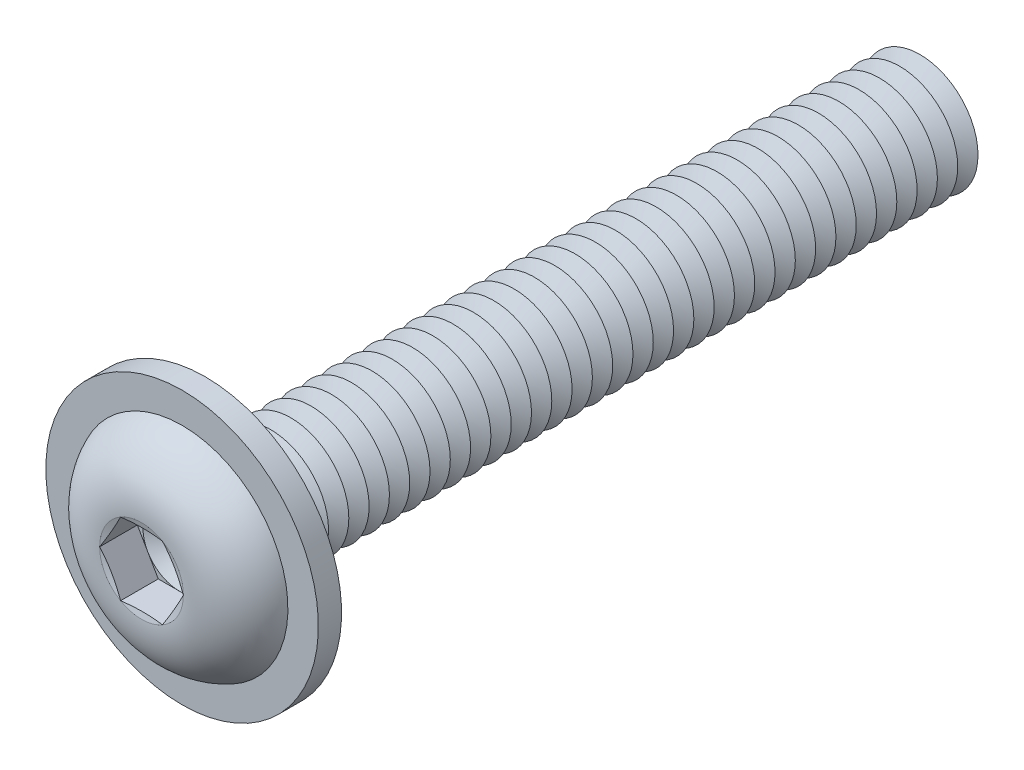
ISO-10303-21;
HEADER;
FILE_DESCRIPTION(('STEP AP214'),'2;1');
FILE_NAME('part.step','',(''),(''),'','','');
FILE_SCHEMA(('AUTOMOTIVE_DESIGN { 1 0 10303 214 1 1 1 1 }'));
ENDSEC;
DATA;
#1=APPLICATION_CONTEXT('core data for automotive mechanical design processes');
#2=APPLICATION_PROTOCOL_DEFINITION('international standard','automotive_design',2000,#1);
#3=PRODUCT_CONTEXT('',#1,'mechanical');
#4=PRODUCT('Part','Part','',(#3));
#5=PRODUCT_RELATED_PRODUCT_CATEGORY('part','',(#4));
#6=PRODUCT_DEFINITION_FORMATION('','',#4);
#7=PRODUCT_DEFINITION_CONTEXT('part definition',#1,'design');
#8=PRODUCT_DEFINITION('design','',#6,#7);
#9=PRODUCT_DEFINITION_SHAPE('','',#8);
#10=(LENGTH_UNIT() NAMED_UNIT(*) SI_UNIT(.MILLI.,.METRE.));
#11=(NAMED_UNIT(*) PLANE_ANGLE_UNIT() SI_UNIT($,.RADIAN.));
#12=(NAMED_UNIT(*) SI_UNIT($,.STERADIAN.) SOLID_ANGLE_UNIT());
#13=UNCERTAINTY_MEASURE_WITH_UNIT(LENGTH_MEASURE(1.E-05),#10,'distance_accuracy_value','');
#14=(GEOMETRIC_REPRESENTATION_CONTEXT(3) GLOBAL_UNCERTAINTY_ASSIGNED_CONTEXT((#13)) GLOBAL_UNIT_ASSIGNED_CONTEXT((#10,
#11,#12)) REPRESENTATION_CONTEXT('',''));
#15=CARTESIAN_POINT('',(0.,0.,0.));
#16=DIRECTION('',(0.,0.,1.));
#17=DIRECTION('',(1.,0.,0.));
#18=AXIS2_PLACEMENT_3D('',#15,#16,#17);
#19=CARTESIAN_POINT('',(0.,0.,-22.55));
#20=DIRECTION('',(0.,0.,1.));
#21=DIRECTION('',(1.,0.,0.));
#22=AXIS2_PLACEMENT_3D('',#19,#20,#21);
#23=CONICAL_SURFACE('',#22,2.00000000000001,1.0471975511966);
#24=CARTESIAN_POINT('',(0.,0.,-22.9));
#25=DIRECTION('',(0.,0.,1.));
#26=DIRECTION('',(1.,0.,0.));
#27=AXIS2_PLACEMENT_3D('',#24,#25,#26);
#28=CIRCLE('',#27,1.3937822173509);
#29=CARTESIAN_POINT('',(1.3937822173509,0.,-22.9));
#30=VERTEX_POINT('',#29);
#31=EDGE_CURVE('E490',#30,#30,#28,.T.);
#32=ORIENTED_EDGE('',*,*,#31,.T.);
#33=EDGE_LOOP('',(#32));
#34=FACE_BOUND('',#33,.T.);
#35=CARTESIAN_POINT('',(0.,0.,-22.55));
#36=DIRECTION('',(0.,0.,1.));
#37=DIRECTION('',(1.,0.,0.));
#38=AXIS2_PLACEMENT_3D('',#35,#36,#37);
#39=CIRCLE('',#38,2.00000000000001);
#40=CARTESIAN_POINT('',(2.00000000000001,0.,-22.55));
#41=VERTEX_POINT('',#40);
#42=EDGE_CURVE('E486',#41,#41,#39,.T.);
#43=ORIENTED_EDGE('',*,*,#42,.F.);
#44=EDGE_LOOP('',(#43));
#45=FACE_BOUND('',#44,.T.);
#46=ADVANCED_FACE('F39',(#34,#45),#23,.T.);
#47=CARTESIAN_POINT('',(0.,0.,-22.9));
#48=DIRECTION('',(0.,0.,-1.));
#49=DIRECTION('',(-1.,0.,0.));
#50=AXIS2_PLACEMENT_3D('',#47,#48,#49);
#51=CONICAL_SURFACE('',#50,1.3937822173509,1.0471975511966);
#52=CARTESIAN_POINT('',(0.,0.,-23.25));
#53=DIRECTION('',(0.,0.,1.));
#54=DIRECTION('',(1.,0.,0.));
#55=AXIS2_PLACEMENT_3D('',#52,#53,#54);
#56=CIRCLE('',#55,2.00000000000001);
#57=CARTESIAN_POINT('',(2.00000000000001,0.,-23.25));
#58=VERTEX_POINT('',#57);
#59=EDGE_CURVE('E494',#58,#58,#56,.T.);
#60=ORIENTED_EDGE('',*,*,#59,.T.);
#61=EDGE_LOOP('',(#60));
#62=FACE_BOUND('',#61,.T.);
#63=ORIENTED_EDGE('',*,*,#31,.F.);
#64=EDGE_LOOP('',(#63));
#65=FACE_BOUND('',#64,.T.);
#66=ADVANCED_FACE('F614',(#62,#65),#51,.T.);
#67=CARTESIAN_POINT('',(0.,2.00000000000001,-25.));
#68=DIRECTION('',(0.,0.,-1.));
#69=DIRECTION('',(-1.,0.,0.));
#70=AXIS2_PLACEMENT_3D('',#67,#68,#69);
#71=PLANE('',#70);
#72=CARTESIAN_POINT('',(0.,0.,-25.));
#73=DIRECTION('',(0.,0.,1.));
#74=DIRECTION('',(1.,0.,0.));
#75=AXIS2_PLACEMENT_3D('',#72,#73,#74);
#76=CIRCLE('',#75,1.3937822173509);
#77=CARTESIAN_POINT('',(1.3937822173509,0.,-25.));
#78=VERTEX_POINT('',#77);
#79=EDGE_CURVE('E514',#78,#78,#76,.T.);
#80=ORIENTED_EDGE('',*,*,#79,.F.);
#81=EDGE_LOOP('',(#80));
#82=FACE_BOUND('',#81,.T.);
#83=ADVANCED_FACE('F620',(#82),#71,.T.);
#84=CARTESIAN_POINT('',(0.,0.,-24.65));
#85=DIRECTION('',(0.,0.,1.));
#86=DIRECTION('',(1.,0.,0.));
#87=AXIS2_PLACEMENT_3D('',#84,#85,#86);
#88=CONICAL_SURFACE('',#87,2.00000000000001,1.0471975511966);
#89=ORIENTED_EDGE('',*,*,#79,.T.);
#90=EDGE_LOOP('',(#89));
#91=FACE_BOUND('',#90,.T.);
#92=CARTESIAN_POINT('',(0.,0.,-24.65));
#93=DIRECTION('',(0.,0.,1.));
#94=DIRECTION('',(1.,0.,0.));
#95=AXIS2_PLACEMENT_3D('',#92,#93,#94);
#96=CIRCLE('',#95,2.00000000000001);
#97=CARTESIAN_POINT('',(2.00000000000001,0.,-24.65));
#98=VERTEX_POINT('',#97);
#99=EDGE_CURVE('E510',#98,#98,#96,.T.);
#100=ORIENTED_EDGE('',*,*,#99,.F.);
#101=EDGE_LOOP('',(#100));
#102=FACE_BOUND('',#101,.T.);
#103=ADVANCED_FACE('F639',(#91,#102),#88,.T.);
#104=CARTESIAN_POINT('',(0.,0.,-24.3));
#105=DIRECTION('',(0.,0.,-1.));
#106=DIRECTION('',(-1.,0.,0.));
#107=AXIS2_PLACEMENT_3D('',#104,#105,#106);
#108=CONICAL_SURFACE('',#107,1.3937822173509,1.0471975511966);
#109=ORIENTED_EDGE('',*,*,#99,.T.);
#110=EDGE_LOOP('',(#109));
#111=FACE_BOUND('',#110,.T.);
#112=CARTESIAN_POINT('',(0.,0.,-24.3));
#113=DIRECTION('',(0.,0.,1.));
#114=DIRECTION('',(1.,0.,0.));
#115=AXIS2_PLACEMENT_3D('',#112,#113,#114);
#116=CIRCLE('',#115,1.3937822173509);
#117=CARTESIAN_POINT('',(1.3937822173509,0.,-24.3));
#118=VERTEX_POINT('',#117);
#119=EDGE_CURVE('E506',#118,#118,#116,.T.);
#120=ORIENTED_EDGE('',*,*,#119,.F.);
#121=EDGE_LOOP('',(#120));
#122=FACE_BOUND('',#121,.T.);
#123=ADVANCED_FACE('F636',(#111,#122),#108,.T.);
#124=CARTESIAN_POINT('',(0.,0.,-23.95));
#125=DIRECTION('',(0.,0.,1.));
#126=DIRECTION('',(1.,0.,0.));
#127=AXIS2_PLACEMENT_3D('',#124,#125,#126);
#128=CONICAL_SURFACE('',#127,2.00000000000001,1.0471975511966);
#129=ORIENTED_EDGE('',*,*,#119,.T.);
#130=EDGE_LOOP('',(#129));
#131=FACE_BOUND('',#130,.T.);
#132=CARTESIAN_POINT('',(0.,0.,-23.95));
#133=DIRECTION('',(0.,0.,1.));
#134=DIRECTION('',(1.,0.,0.));
#135=AXIS2_PLACEMENT_3D('',#132,#133,#134);
#136=CIRCLE('',#135,2.00000000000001);
#137=CARTESIAN_POINT('',(2.00000000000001,0.,-23.95));
#138=VERTEX_POINT('',#137);
#139=EDGE_CURVE('E502',#138,#138,#136,.T.);
#140=ORIENTED_EDGE('',*,*,#139,.F.);
#141=EDGE_LOOP('',(#140));
#142=FACE_BOUND('',#141,.T.);
#143=ADVANCED_FACE('F630',(#131,#142),#128,.T.);
#144=CARTESIAN_POINT('',(0.,0.,-23.6));
#145=DIRECTION('',(0.,0.,-1.));
#146=DIRECTION('',(-1.,0.,0.));
#147=AXIS2_PLACEMENT_3D('',#144,#145,#146);
#148=CONICAL_SURFACE('',#147,1.3937822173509,1.0471975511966);
#149=ORIENTED_EDGE('',*,*,#139,.T.);
#150=EDGE_LOOP('',(#149));
#151=FACE_BOUND('',#150,.T.);
#152=CARTESIAN_POINT('',(0.,0.,-23.6));
#153=DIRECTION('',(0.,0.,1.));
#154=DIRECTION('',(1.,0.,0.));
#155=AXIS2_PLACEMENT_3D('',#152,#153,#154);
#156=CIRCLE('',#155,1.3937822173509);
#157=CARTESIAN_POINT('',(1.3937822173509,0.,-23.6));
#158=VERTEX_POINT('',#157);
#159=EDGE_CURVE('E498',#158,#158,#156,.T.);
#160=ORIENTED_EDGE('',*,*,#159,.F.);
#161=EDGE_LOOP('',(#160));
#162=FACE_BOUND('',#161,.T.);
#163=ADVANCED_FACE('F626',(#151,#162),#148,.T.);
#164=CARTESIAN_POINT('',(0.,0.,-23.25));
#165=DIRECTION('',(0.,0.,1.));
#166=DIRECTION('',(1.,0.,0.));
#167=AXIS2_PLACEMENT_3D('',#164,#165,#166);
#168=CONICAL_SURFACE('',#167,2.00000000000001,1.0471975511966);
#169=ORIENTED_EDGE('',*,*,#159,.T.);
#170=EDGE_LOOP('',(#169));
#171=FACE_BOUND('',#170,.T.);
#172=ORIENTED_EDGE('',*,*,#59,.F.);
#173=EDGE_LOOP('',(#172));
#174=FACE_BOUND('',#173,.T.);
#175=ADVANCED_FACE('F629',(#171,#174),#168,.T.);
#176=CARTESIAN_POINT('',(0.,0.,-21.85));
#177=DIRECTION('',(0.,0.,1.));
#178=DIRECTION('',(1.,0.,0.));
#179=AXIS2_PLACEMENT_3D('',#176,#177,#178);
#180=CONICAL_SURFACE('',#179,2.00000000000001,1.0471975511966);
#181=CARTESIAN_POINT('',(0.,0.,-22.2));
#182=DIRECTION('',(0.,0.,1.));
#183=DIRECTION('',(1.,0.,0.));
#184=AXIS2_PLACEMENT_3D('',#181,#182,#183);
#185=CIRCLE('',#184,1.3937822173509);
#186=CARTESIAN_POINT('',(1.3937822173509,0.,-22.2));
#187=VERTEX_POINT('',#186);
#188=EDGE_CURVE('E482',#187,#187,#185,.T.);
#189=ORIENTED_EDGE('',*,*,#188,.T.);
#190=EDGE_LOOP('',(#189));
#191=FACE_BOUND('',#190,.T.);
#192=CARTESIAN_POINT('',(0.,0.,-21.85));
#193=DIRECTION('',(0.,0.,1.));
#194=DIRECTION('',(1.,0.,0.));
#195=AXIS2_PLACEMENT_3D('',#192,#193,#194);
#196=CIRCLE('',#195,2.00000000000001);
#197=CARTESIAN_POINT('',(2.00000000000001,0.,-21.85));
#198=VERTEX_POINT('',#197);
#199=EDGE_CURVE('E478',#198,#198,#196,.T.);
#200=ORIENTED_EDGE('',*,*,#199,.F.);
#201=EDGE_LOOP('',(#200));
#202=FACE_BOUND('',#201,.T.);
#203=ADVANCED_FACE('F634',(#191,#202),#180,.T.);
#204=CARTESIAN_POINT('',(0.,0.,-22.2));
#205=DIRECTION('',(0.,0.,-1.));
#206=DIRECTION('',(-1.,0.,0.));
#207=AXIS2_PLACEMENT_3D('',#204,#205,#206);
#208=CONICAL_SURFACE('',#207,1.3937822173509,1.0471975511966);
#209=ORIENTED_EDGE('',*,*,#42,.T.);
#210=EDGE_LOOP('',(#209));
#211=FACE_BOUND('',#210,.T.);
#212=ORIENTED_EDGE('',*,*,#188,.F.);
#213=EDGE_LOOP('',(#212));
#214=FACE_BOUND('',#213,.T.);
#215=ADVANCED_FACE('F685',(#211,#214),#208,.T.);
#216=CARTESIAN_POINT('',(0.,0.,-21.15));
#217=DIRECTION('',(0.,0.,1.));
#218=DIRECTION('',(1.,0.,0.));
#219=AXIS2_PLACEMENT_3D('',#216,#217,#218);
#220=CONICAL_SURFACE('',#219,2.00000000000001,1.0471975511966);
#221=CARTESIAN_POINT('',(0.,0.,-21.5));
#222=DIRECTION('',(0.,0.,1.));
#223=DIRECTION('',(1.,0.,0.));
#224=AXIS2_PLACEMENT_3D('',#221,#222,#223);
#225=CIRCLE('',#224,1.3937822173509);
#226=CARTESIAN_POINT('',(1.3937822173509,0.,-21.5));
#227=VERTEX_POINT('',#226);
#228=EDGE_CURVE('E474',#227,#227,#225,.T.);
#229=ORIENTED_EDGE('',*,*,#228,.T.);
#230=EDGE_LOOP('',(#229));
#231=FACE_BOUND('',#230,.T.);
#232=CARTESIAN_POINT('',(0.,0.,-21.15));
#233=DIRECTION('',(0.,0.,1.));
#234=DIRECTION('',(1.,0.,0.));
#235=AXIS2_PLACEMENT_3D('',#232,#233,#234);
#236=CIRCLE('',#235,2.00000000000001);
#237=CARTESIAN_POINT('',(2.00000000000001,0.,-21.15));
#238=VERTEX_POINT('',#237);
#239=EDGE_CURVE('E470',#238,#238,#236,.T.);
#240=ORIENTED_EDGE('',*,*,#239,.F.);
#241=EDGE_LOOP('',(#240));
#242=FACE_BOUND('',#241,.T.);
#243=ADVANCED_FACE('F691',(#231,#242),#220,.T.);
#244=CARTESIAN_POINT('',(0.,0.,-21.5));
#245=DIRECTION('',(0.,0.,-1.));
#246=DIRECTION('',(-1.,0.,0.));
#247=AXIS2_PLACEMENT_3D('',#244,#245,#246);
#248=CONICAL_SURFACE('',#247,1.3937822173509,1.0471975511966);
#249=ORIENTED_EDGE('',*,*,#199,.T.);
#250=EDGE_LOOP('',(#249));
#251=FACE_BOUND('',#250,.T.);
#252=ORIENTED_EDGE('',*,*,#228,.F.);
#253=EDGE_LOOP('',(#252));
#254=FACE_BOUND('',#253,.T.);
#255=ADVANCED_FACE('F698',(#251,#254),#248,.T.);
#256=CARTESIAN_POINT('',(0.,0.,-20.45));
#257=DIRECTION('',(0.,0.,1.));
#258=DIRECTION('',(1.,0.,0.));
#259=AXIS2_PLACEMENT_3D('',#256,#257,#258);
#260=CONICAL_SURFACE('',#259,2.00000000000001,1.0471975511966);
#261=CARTESIAN_POINT('',(0.,0.,-20.8));
#262=DIRECTION('',(0.,0.,1.));
#263=DIRECTION('',(1.,0.,0.));
#264=AXIS2_PLACEMENT_3D('',#261,#262,#263);
#265=CIRCLE('',#264,1.3937822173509);
#266=CARTESIAN_POINT('',(1.3937822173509,0.,-20.8));
#267=VERTEX_POINT('',#266);
#268=EDGE_CURVE('E466',#267,#267,#265,.T.);
#269=ORIENTED_EDGE('',*,*,#268,.T.);
#270=EDGE_LOOP('',(#269));
#271=FACE_BOUND('',#270,.T.);
#272=CARTESIAN_POINT('',(0.,0.,-20.45));
#273=DIRECTION('',(0.,0.,1.));
#274=DIRECTION('',(1.,0.,0.));
#275=AXIS2_PLACEMENT_3D('',#272,#273,#274);
#276=CIRCLE('',#275,2.00000000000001);
#277=CARTESIAN_POINT('',(2.00000000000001,0.,-20.45));
#278=VERTEX_POINT('',#277);
#279=EDGE_CURVE('E462',#278,#278,#276,.T.);
#280=ORIENTED_EDGE('',*,*,#279,.F.);
#281=EDGE_LOOP('',(#280));
#282=FACE_BOUND('',#281,.T.);
#283=ADVANCED_FACE('F705',(#271,#282),#260,.T.);
#284=CARTESIAN_POINT('',(0.,0.,-20.8));
#285=DIRECTION('',(0.,0.,-1.));
#286=DIRECTION('',(-1.,0.,0.));
#287=AXIS2_PLACEMENT_3D('',#284,#285,#286);
#288=CONICAL_SURFACE('',#287,1.3937822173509,1.0471975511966);
#289=ORIENTED_EDGE('',*,*,#239,.T.);
#290=EDGE_LOOP('',(#289));
#291=FACE_BOUND('',#290,.T.);
#292=ORIENTED_EDGE('',*,*,#268,.F.);
#293=EDGE_LOOP('',(#292));
#294=FACE_BOUND('',#293,.T.);
#295=ADVANCED_FACE('F712',(#291,#294),#288,.T.);
#296=CARTESIAN_POINT('',(0.,0.,-19.75));
#297=DIRECTION('',(0.,0.,1.));
#298=DIRECTION('',(1.,0.,0.));
#299=AXIS2_PLACEMENT_3D('',#296,#297,#298);
#300=CONICAL_SURFACE('',#299,2.00000000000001,1.0471975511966);
#301=CARTESIAN_POINT('',(0.,0.,-20.1));
#302=DIRECTION('',(0.,0.,1.));
#303=DIRECTION('',(1.,0.,0.));
#304=AXIS2_PLACEMENT_3D('',#301,#302,#303);
#305=CIRCLE('',#304,1.3937822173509);
#306=CARTESIAN_POINT('',(1.3937822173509,0.,-20.1));
#307=VERTEX_POINT('',#306);
#308=EDGE_CURVE('E458',#307,#307,#305,.T.);
#309=ORIENTED_EDGE('',*,*,#308,.T.);
#310=EDGE_LOOP('',(#309));
#311=FACE_BOUND('',#310,.T.);
#312=CARTESIAN_POINT('',(0.,0.,-19.75));
#313=DIRECTION('',(0.,0.,1.));
#314=DIRECTION('',(1.,0.,0.));
#315=AXIS2_PLACEMENT_3D('',#312,#313,#314);
#316=CIRCLE('',#315,2.00000000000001);
#317=CARTESIAN_POINT('',(2.00000000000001,0.,-19.75));
#318=VERTEX_POINT('',#317);
#319=EDGE_CURVE('E454',#318,#318,#316,.T.);
#320=ORIENTED_EDGE('',*,*,#319,.F.);
#321=EDGE_LOOP('',(#320));
#322=FACE_BOUND('',#321,.T.);
#323=ADVANCED_FACE('F719',(#311,#322),#300,.T.);
#324=CARTESIAN_POINT('',(0.,0.,-20.1));
#325=DIRECTION('',(0.,0.,-1.));
#326=DIRECTION('',(-1.,0.,0.));
#327=AXIS2_PLACEMENT_3D('',#324,#325,#326);
#328=CONICAL_SURFACE('',#327,1.3937822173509,1.0471975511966);
#329=ORIENTED_EDGE('',*,*,#279,.T.);
#330=EDGE_LOOP('',(#329));
#331=FACE_BOUND('',#330,.T.);
#332=ORIENTED_EDGE('',*,*,#308,.F.);
#333=EDGE_LOOP('',(#332));
#334=FACE_BOUND('',#333,.T.);
#335=ADVANCED_FACE('F726',(#331,#334),#328,.T.);
#336=CARTESIAN_POINT('',(0.,0.,-19.05));
#337=DIRECTION('',(0.,0.,1.));
#338=DIRECTION('',(1.,0.,0.));
#339=AXIS2_PLACEMENT_3D('',#336,#337,#338);
#340=CONICAL_SURFACE('',#339,2.00000000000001,1.0471975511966);
#341=CARTESIAN_POINT('',(0.,0.,-19.4));
#342=DIRECTION('',(0.,0.,1.));
#343=DIRECTION('',(1.,0.,0.));
#344=AXIS2_PLACEMENT_3D('',#341,#342,#343);
#345=CIRCLE('',#344,1.3937822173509);
#346=CARTESIAN_POINT('',(1.3937822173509,0.,-19.4));
#347=VERTEX_POINT('',#346);
#348=EDGE_CURVE('E450',#347,#347,#345,.T.);
#349=ORIENTED_EDGE('',*,*,#348,.T.);
#350=EDGE_LOOP('',(#349));
#351=FACE_BOUND('',#350,.T.);
#352=CARTESIAN_POINT('',(0.,0.,-19.05));
#353=DIRECTION('',(0.,0.,1.));
#354=DIRECTION('',(1.,0.,0.));
#355=AXIS2_PLACEMENT_3D('',#352,#353,#354);
#356=CIRCLE('',#355,2.00000000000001);
#357=CARTESIAN_POINT('',(2.00000000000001,0.,-19.05));
#358=VERTEX_POINT('',#357);
#359=EDGE_CURVE('E446',#358,#358,#356,.T.);
#360=ORIENTED_EDGE('',*,*,#359,.F.);
#361=EDGE_LOOP('',(#360));
#362=FACE_BOUND('',#361,.T.);
#363=ADVANCED_FACE('F733',(#351,#362),#340,.T.);
#364=CARTESIAN_POINT('',(0.,0.,-19.4));
#365=DIRECTION('',(0.,0.,-1.));
#366=DIRECTION('',(-1.,0.,0.));
#367=AXIS2_PLACEMENT_3D('',#364,#365,#366);
#368=CONICAL_SURFACE('',#367,1.3937822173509,1.0471975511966);
#369=ORIENTED_EDGE('',*,*,#319,.T.);
#370=EDGE_LOOP('',(#369));
#371=FACE_BOUND('',#370,.T.);
#372=ORIENTED_EDGE('',*,*,#348,.F.);
#373=EDGE_LOOP('',(#372));
#374=FACE_BOUND('',#373,.T.);
#375=ADVANCED_FACE('F740',(#371,#374),#368,.T.);
#376=CARTESIAN_POINT('',(0.,0.,-18.35));
#377=DIRECTION('',(0.,0.,1.));
#378=DIRECTION('',(1.,0.,0.));
#379=AXIS2_PLACEMENT_3D('',#376,#377,#378);
#380=CONICAL_SURFACE('',#379,2.00000000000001,1.0471975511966);
#381=CARTESIAN_POINT('',(0.,0.,-18.7));
#382=DIRECTION('',(0.,0.,1.));
#383=DIRECTION('',(1.,0.,0.));
#384=AXIS2_PLACEMENT_3D('',#381,#382,#383);
#385=CIRCLE('',#384,1.3937822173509);
#386=CARTESIAN_POINT('',(1.3937822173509,0.,-18.7));
#387=VERTEX_POINT('',#386);
#388=EDGE_CURVE('E442',#387,#387,#385,.T.);
#389=ORIENTED_EDGE('',*,*,#388,.T.);
#390=EDGE_LOOP('',(#389));
#391=FACE_BOUND('',#390,.T.);
#392=CARTESIAN_POINT('',(0.,0.,-18.35));
#393=DIRECTION('',(0.,0.,1.));
#394=DIRECTION('',(1.,0.,0.));
#395=AXIS2_PLACEMENT_3D('',#392,#393,#394);
#396=CIRCLE('',#395,2.00000000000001);
#397=CARTESIAN_POINT('',(2.00000000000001,0.,-18.35));
#398=VERTEX_POINT('',#397);
#399=EDGE_CURVE('E438',#398,#398,#396,.T.);
#400=ORIENTED_EDGE('',*,*,#399,.F.);
#401=EDGE_LOOP('',(#400));
#402=FACE_BOUND('',#401,.T.);
#403=ADVANCED_FACE('F747',(#391,#402),#380,.T.);
#404=CARTESIAN_POINT('',(0.,0.,-18.7));
#405=DIRECTION('',(0.,0.,-1.));
#406=DIRECTION('',(-1.,0.,0.));
#407=AXIS2_PLACEMENT_3D('',#404,#405,#406);
#408=CONICAL_SURFACE('',#407,1.3937822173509,1.0471975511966);
#409=ORIENTED_EDGE('',*,*,#359,.T.);
#410=EDGE_LOOP('',(#409));
#411=FACE_BOUND('',#410,.T.);
#412=ORIENTED_EDGE('',*,*,#388,.F.);
#413=EDGE_LOOP('',(#412));
#414=FACE_BOUND('',#413,.T.);
#415=ADVANCED_FACE('F754',(#411,#414),#408,.T.);
#416=CARTESIAN_POINT('',(0.,0.,-17.65));
#417=DIRECTION('',(0.,0.,1.));
#418=DIRECTION('',(1.,0.,0.));
#419=AXIS2_PLACEMENT_3D('',#416,#417,#418);
#420=CONICAL_SURFACE('',#419,2.00000000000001,1.0471975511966);
#421=CARTESIAN_POINT('',(0.,0.,-18.));
#422=DIRECTION('',(0.,0.,1.));
#423=DIRECTION('',(1.,0.,0.));
#424=AXIS2_PLACEMENT_3D('',#421,#422,#423);
#425=CIRCLE('',#424,1.3937822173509);
#426=CARTESIAN_POINT('',(1.3937822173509,0.,-18.));
#427=VERTEX_POINT('',#426);
#428=EDGE_CURVE('E434',#427,#427,#425,.T.);
#429=ORIENTED_EDGE('',*,*,#428,.T.);
#430=EDGE_LOOP('',(#429));
#431=FACE_BOUND('',#430,.T.);
#432=CARTESIAN_POINT('',(0.,0.,-17.65));
#433=DIRECTION('',(0.,0.,1.));
#434=DIRECTION('',(1.,0.,0.));
#435=AXIS2_PLACEMENT_3D('',#432,#433,#434);
#436=CIRCLE('',#435,2.00000000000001);
#437=CARTESIAN_POINT('',(2.00000000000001,0.,-17.65));
#438=VERTEX_POINT('',#437);
#439=EDGE_CURVE('E430',#438,#438,#436,.T.);
#440=ORIENTED_EDGE('',*,*,#439,.F.);
#441=EDGE_LOOP('',(#440));
#442=FACE_BOUND('',#441,.T.);
#443=ADVANCED_FACE('F761',(#431,#442),#420,.T.);
#444=CARTESIAN_POINT('',(0.,0.,-18.));
#445=DIRECTION('',(0.,0.,-1.));
#446=DIRECTION('',(-1.,0.,0.));
#447=AXIS2_PLACEMENT_3D('',#444,#445,#446);
#448=CONICAL_SURFACE('',#447,1.3937822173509,1.0471975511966);
#449=ORIENTED_EDGE('',*,*,#399,.T.);
#450=EDGE_LOOP('',(#449));
#451=FACE_BOUND('',#450,.T.);
#452=ORIENTED_EDGE('',*,*,#428,.F.);
#453=EDGE_LOOP('',(#452));
#454=FACE_BOUND('',#453,.T.);
#455=ADVANCED_FACE('F768',(#451,#454),#448,.T.);
#456=CARTESIAN_POINT('',(0.,0.,-16.95));
#457=DIRECTION('',(0.,0.,1.));
#458=DIRECTION('',(1.,0.,0.));
#459=AXIS2_PLACEMENT_3D('',#456,#457,#458);
#460=CONICAL_SURFACE('',#459,2.00000000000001,1.0471975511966);
#461=CARTESIAN_POINT('',(0.,0.,-17.3));
#462=DIRECTION('',(0.,0.,1.));
#463=DIRECTION('',(1.,0.,0.));
#464=AXIS2_PLACEMENT_3D('',#461,#462,#463);
#465=CIRCLE('',#464,1.3937822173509);
#466=CARTESIAN_POINT('',(1.3937822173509,0.,-17.3));
#467=VERTEX_POINT('',#466);
#468=EDGE_CURVE('E426',#467,#467,#465,.T.);
#469=ORIENTED_EDGE('',*,*,#468,.T.);
#470=EDGE_LOOP('',(#469));
#471=FACE_BOUND('',#470,.T.);
#472=CARTESIAN_POINT('',(0.,0.,-16.95));
#473=DIRECTION('',(0.,0.,1.));
#474=DIRECTION('',(1.,0.,0.));
#475=AXIS2_PLACEMENT_3D('',#472,#473,#474);
#476=CIRCLE('',#475,2.00000000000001);
#477=CARTESIAN_POINT('',(2.00000000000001,0.,-16.95));
#478=VERTEX_POINT('',#477);
#479=EDGE_CURVE('E422',#478,#478,#476,.T.);
#480=ORIENTED_EDGE('',*,*,#479,.F.);
#481=EDGE_LOOP('',(#480));
#482=FACE_BOUND('',#481,.T.);
#483=ADVANCED_FACE('F775',(#471,#482),#460,.T.);
#484=CARTESIAN_POINT('',(0.,0.,-17.3));
#485=DIRECTION('',(0.,0.,-1.));
#486=DIRECTION('',(-1.,0.,0.));
#487=AXIS2_PLACEMENT_3D('',#484,#485,#486);
#488=CONICAL_SURFACE('',#487,1.3937822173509,1.0471975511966);
#489=ORIENTED_EDGE('',*,*,#439,.T.);
#490=EDGE_LOOP('',(#489));
#491=FACE_BOUND('',#490,.T.);
#492=ORIENTED_EDGE('',*,*,#468,.F.);
#493=EDGE_LOOP('',(#492));
#494=FACE_BOUND('',#493,.T.);
#495=ADVANCED_FACE('F782',(#491,#494),#488,.T.);
#496=CARTESIAN_POINT('',(0.,0.,-16.25));
#497=DIRECTION('',(0.,0.,1.));
#498=DIRECTION('',(1.,0.,0.));
#499=AXIS2_PLACEMENT_3D('',#496,#497,#498);
#500=CONICAL_SURFACE('',#499,2.00000000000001,1.0471975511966);
#501=CARTESIAN_POINT('',(0.,0.,-16.6));
#502=DIRECTION('',(0.,0.,1.));
#503=DIRECTION('',(1.,0.,0.));
#504=AXIS2_PLACEMENT_3D('',#501,#502,#503);
#505=CIRCLE('',#504,1.3937822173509);
#506=CARTESIAN_POINT('',(1.3937822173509,0.,-16.6));
#507=VERTEX_POINT('',#506);
#508=EDGE_CURVE('E418',#507,#507,#505,.T.);
#509=ORIENTED_EDGE('',*,*,#508,.T.);
#510=EDGE_LOOP('',(#509));
#511=FACE_BOUND('',#510,.T.);
#512=CARTESIAN_POINT('',(0.,0.,-16.25));
#513=DIRECTION('',(0.,0.,1.));
#514=DIRECTION('',(1.,0.,0.));
#515=AXIS2_PLACEMENT_3D('',#512,#513,#514);
#516=CIRCLE('',#515,2.00000000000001);
#517=CARTESIAN_POINT('',(2.00000000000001,0.,-16.25));
#518=VERTEX_POINT('',#517);
#519=EDGE_CURVE('E414',#518,#518,#516,.T.);
#520=ORIENTED_EDGE('',*,*,#519,.F.);
#521=EDGE_LOOP('',(#520));
#522=FACE_BOUND('',#521,.T.);
#523=ADVANCED_FACE('F789',(#511,#522),#500,.T.);
#524=CARTESIAN_POINT('',(0.,0.,-16.6));
#525=DIRECTION('',(0.,0.,-1.));
#526=DIRECTION('',(-1.,0.,0.));
#527=AXIS2_PLACEMENT_3D('',#524,#525,#526);
#528=CONICAL_SURFACE('',#527,1.3937822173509,1.0471975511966);
#529=ORIENTED_EDGE('',*,*,#479,.T.);
#530=EDGE_LOOP('',(#529));
#531=FACE_BOUND('',#530,.T.);
#532=ORIENTED_EDGE('',*,*,#508,.F.);
#533=EDGE_LOOP('',(#532));
#534=FACE_BOUND('',#533,.T.);
#535=ADVANCED_FACE('F796',(#531,#534),#528,.T.);
#536=CARTESIAN_POINT('',(0.,0.,-15.55));
#537=DIRECTION('',(0.,0.,1.));
#538=DIRECTION('',(1.,0.,0.));
#539=AXIS2_PLACEMENT_3D('',#536,#537,#538);
#540=CONICAL_SURFACE('',#539,2.00000000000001,1.0471975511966);
#541=CARTESIAN_POINT('',(0.,0.,-15.9));
#542=DIRECTION('',(0.,0.,1.));
#543=DIRECTION('',(1.,0.,0.));
#544=AXIS2_PLACEMENT_3D('',#541,#542,#543);
#545=CIRCLE('',#544,1.3937822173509);
#546=CARTESIAN_POINT('',(1.3937822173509,0.,-15.9));
#547=VERTEX_POINT('',#546);
#548=EDGE_CURVE('E410',#547,#547,#545,.T.);
#549=ORIENTED_EDGE('',*,*,#548,.T.);
#550=EDGE_LOOP('',(#549));
#551=FACE_BOUND('',#550,.T.);
#552=CARTESIAN_POINT('',(0.,0.,-15.55));
#553=DIRECTION('',(0.,0.,1.));
#554=DIRECTION('',(1.,0.,0.));
#555=AXIS2_PLACEMENT_3D('',#552,#553,#554);
#556=CIRCLE('',#555,2.00000000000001);
#557=CARTESIAN_POINT('',(2.00000000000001,0.,-15.55));
#558=VERTEX_POINT('',#557);
#559=EDGE_CURVE('E406',#558,#558,#556,.T.);
#560=ORIENTED_EDGE('',*,*,#559,.F.);
#561=EDGE_LOOP('',(#560));
#562=FACE_BOUND('',#561,.T.);
#563=ADVANCED_FACE('F803',(#551,#562),#540,.T.);
#564=CARTESIAN_POINT('',(0.,0.,-15.9));
#565=DIRECTION('',(0.,0.,-1.));
#566=DIRECTION('',(-1.,0.,0.));
#567=AXIS2_PLACEMENT_3D('',#564,#565,#566);
#568=CONICAL_SURFACE('',#567,1.3937822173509,1.0471975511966);
#569=ORIENTED_EDGE('',*,*,#519,.T.);
#570=EDGE_LOOP('',(#569));
#571=FACE_BOUND('',#570,.T.);
#572=ORIENTED_EDGE('',*,*,#548,.F.);
#573=EDGE_LOOP('',(#572));
#574=FACE_BOUND('',#573,.T.);
#575=ADVANCED_FACE('F810',(#571,#574),#568,.T.);
#576=CARTESIAN_POINT('',(0.,0.,-14.85));
#577=DIRECTION('',(0.,0.,1.));
#578=DIRECTION('',(1.,0.,0.));
#579=AXIS2_PLACEMENT_3D('',#576,#577,#578);
#580=CONICAL_SURFACE('',#579,2.00000000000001,1.0471975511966);
#581=CARTESIAN_POINT('',(0.,0.,-15.2));
#582=DIRECTION('',(0.,0.,1.));
#583=DIRECTION('',(1.,0.,0.));
#584=AXIS2_PLACEMENT_3D('',#581,#582,#583);
#585=CIRCLE('',#584,1.3937822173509);
#586=CARTESIAN_POINT('',(1.3937822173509,0.,-15.2));
#587=VERTEX_POINT('',#586);
#588=EDGE_CURVE('E402',#587,#587,#585,.T.);
#589=ORIENTED_EDGE('',*,*,#588,.T.);
#590=EDGE_LOOP('',(#589));
#591=FACE_BOUND('',#590,.T.);
#592=CARTESIAN_POINT('',(0.,0.,-14.85));
#593=DIRECTION('',(0.,0.,1.));
#594=DIRECTION('',(1.,0.,0.));
#595=AXIS2_PLACEMENT_3D('',#592,#593,#594);
#596=CIRCLE('',#595,2.00000000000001);
#597=CARTESIAN_POINT('',(2.00000000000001,0.,-14.85));
#598=VERTEX_POINT('',#597);
#599=EDGE_CURVE('E398',#598,#598,#596,.T.);
#600=ORIENTED_EDGE('',*,*,#599,.F.);
#601=EDGE_LOOP('',(#600));
#602=FACE_BOUND('',#601,.T.);
#603=ADVANCED_FACE('F817',(#591,#602),#580,.T.);
#604=CARTESIAN_POINT('',(0.,0.,-15.2));
#605=DIRECTION('',(0.,0.,-1.));
#606=DIRECTION('',(-1.,0.,0.));
#607=AXIS2_PLACEMENT_3D('',#604,#605,#606);
#608=CONICAL_SURFACE('',#607,1.3937822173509,1.0471975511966);
#609=ORIENTED_EDGE('',*,*,#559,.T.);
#610=EDGE_LOOP('',(#609));
#611=FACE_BOUND('',#610,.T.);
#612=ORIENTED_EDGE('',*,*,#588,.F.);
#613=EDGE_LOOP('',(#612));
#614=FACE_BOUND('',#613,.T.);
#615=ADVANCED_FACE('F824',(#611,#614),#608,.T.);
#616=CARTESIAN_POINT('',(0.,0.,-14.15));
#617=DIRECTION('',(0.,0.,1.));
#618=DIRECTION('',(1.,0.,0.));
#619=AXIS2_PLACEMENT_3D('',#616,#617,#618);
#620=CONICAL_SURFACE('',#619,2.00000000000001,1.0471975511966);
#621=CARTESIAN_POINT('',(0.,0.,-14.5));
#622=DIRECTION('',(0.,0.,1.));
#623=DIRECTION('',(1.,0.,0.));
#624=AXIS2_PLACEMENT_3D('',#621,#622,#623);
#625=CIRCLE('',#624,1.3937822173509);
#626=CARTESIAN_POINT('',(1.3937822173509,0.,-14.5));
#627=VERTEX_POINT('',#626);
#628=EDGE_CURVE('E394',#627,#627,#625,.T.);
#629=ORIENTED_EDGE('',*,*,#628,.T.);
#630=EDGE_LOOP('',(#629));
#631=FACE_BOUND('',#630,.T.);
#632=CARTESIAN_POINT('',(0.,0.,-14.15));
#633=DIRECTION('',(0.,0.,1.));
#634=DIRECTION('',(1.,0.,0.));
#635=AXIS2_PLACEMENT_3D('',#632,#633,#634);
#636=CIRCLE('',#635,2.00000000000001);
#637=CARTESIAN_POINT('',(2.00000000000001,0.,-14.15));
#638=VERTEX_POINT('',#637);
#639=EDGE_CURVE('E390',#638,#638,#636,.T.);
#640=ORIENTED_EDGE('',*,*,#639,.F.);
#641=EDGE_LOOP('',(#640));
#642=FACE_BOUND('',#641,.T.);
#643=ADVANCED_FACE('F831',(#631,#642),#620,.T.);
#644=CARTESIAN_POINT('',(0.,0.,-14.5));
#645=DIRECTION('',(0.,0.,-1.));
#646=DIRECTION('',(-1.,0.,0.));
#647=AXIS2_PLACEMENT_3D('',#644,#645,#646);
#648=CONICAL_SURFACE('',#647,1.3937822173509,1.0471975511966);
#649=ORIENTED_EDGE('',*,*,#599,.T.);
#650=EDGE_LOOP('',(#649));
#651=FACE_BOUND('',#650,.T.);
#652=ORIENTED_EDGE('',*,*,#628,.F.);
#653=EDGE_LOOP('',(#652));
#654=FACE_BOUND('',#653,.T.);
#655=ADVANCED_FACE('F838',(#651,#654),#648,.T.);
#656=CARTESIAN_POINT('',(0.,0.,-13.45));
#657=DIRECTION('',(0.,0.,1.));
#658=DIRECTION('',(1.,0.,0.));
#659=AXIS2_PLACEMENT_3D('',#656,#657,#658);
#660=CONICAL_SURFACE('',#659,2.00000000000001,1.0471975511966);
#661=CARTESIAN_POINT('',(0.,0.,-13.8));
#662=DIRECTION('',(0.,0.,1.));
#663=DIRECTION('',(1.,0.,0.));
#664=AXIS2_PLACEMENT_3D('',#661,#662,#663);
#665=CIRCLE('',#664,1.3937822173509);
#666=CARTESIAN_POINT('',(1.3937822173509,0.,-13.8));
#667=VERTEX_POINT('',#666);
#668=EDGE_CURVE('E386',#667,#667,#665,.T.);
#669=ORIENTED_EDGE('',*,*,#668,.T.);
#670=EDGE_LOOP('',(#669));
#671=FACE_BOUND('',#670,.T.);
#672=CARTESIAN_POINT('',(0.,0.,-13.45));
#673=DIRECTION('',(0.,0.,1.));
#674=DIRECTION('',(1.,0.,0.));
#675=AXIS2_PLACEMENT_3D('',#672,#673,#674);
#676=CIRCLE('',#675,2.00000000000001);
#677=CARTESIAN_POINT('',(2.00000000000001,0.,-13.45));
#678=VERTEX_POINT('',#677);
#679=EDGE_CURVE('E382',#678,#678,#676,.T.);
#680=ORIENTED_EDGE('',*,*,#679,.F.);
#681=EDGE_LOOP('',(#680));
#682=FACE_BOUND('',#681,.T.);
#683=ADVANCED_FACE('F845',(#671,#682),#660,.T.);
#684=CARTESIAN_POINT('',(0.,0.,-13.8));
#685=DIRECTION('',(0.,0.,-1.));
#686=DIRECTION('',(-1.,0.,0.));
#687=AXIS2_PLACEMENT_3D('',#684,#685,#686);
#688=CONICAL_SURFACE('',#687,1.3937822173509,1.0471975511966);
#689=ORIENTED_EDGE('',*,*,#639,.T.);
#690=EDGE_LOOP('',(#689));
#691=FACE_BOUND('',#690,.T.);
#692=ORIENTED_EDGE('',*,*,#668,.F.);
#693=EDGE_LOOP('',(#692));
#694=FACE_BOUND('',#693,.T.);
#695=ADVANCED_FACE('F852',(#691,#694),#688,.T.);
#696=CARTESIAN_POINT('',(0.,0.,-12.75));
#697=DIRECTION('',(0.,0.,1.));
#698=DIRECTION('',(1.,0.,0.));
#699=AXIS2_PLACEMENT_3D('',#696,#697,#698);
#700=CONICAL_SURFACE('',#699,2.00000000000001,1.0471975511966);
#701=CARTESIAN_POINT('',(0.,0.,-13.1));
#702=DIRECTION('',(0.,0.,1.));
#703=DIRECTION('',(1.,0.,0.));
#704=AXIS2_PLACEMENT_3D('',#701,#702,#703);
#705=CIRCLE('',#704,1.3937822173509);
#706=CARTESIAN_POINT('',(1.3937822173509,0.,-13.1));
#707=VERTEX_POINT('',#706);
#708=EDGE_CURVE('E378',#707,#707,#705,.T.);
#709=ORIENTED_EDGE('',*,*,#708,.T.);
#710=EDGE_LOOP('',(#709));
#711=FACE_BOUND('',#710,.T.);
#712=CARTESIAN_POINT('',(0.,0.,-12.75));
#713=DIRECTION('',(0.,0.,1.));
#714=DIRECTION('',(1.,0.,0.));
#715=AXIS2_PLACEMENT_3D('',#712,#713,#714);
#716=CIRCLE('',#715,2.00000000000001);
#717=CARTESIAN_POINT('',(2.00000000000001,0.,-12.75));
#718=VERTEX_POINT('',#717);
#719=EDGE_CURVE('E374',#718,#718,#716,.T.);
#720=ORIENTED_EDGE('',*,*,#719,.F.);
#721=EDGE_LOOP('',(#720));
#722=FACE_BOUND('',#721,.T.);
#723=ADVANCED_FACE('F859',(#711,#722),#700,.T.);
#724=CARTESIAN_POINT('',(0.,0.,-13.1));
#725=DIRECTION('',(0.,0.,-1.));
#726=DIRECTION('',(-1.,0.,0.));
#727=AXIS2_PLACEMENT_3D('',#724,#725,#726);
#728=CONICAL_SURFACE('',#727,1.3937822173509,1.0471975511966);
#729=ORIENTED_EDGE('',*,*,#679,.T.);
#730=EDGE_LOOP('',(#729));
#731=FACE_BOUND('',#730,.T.);
#732=ORIENTED_EDGE('',*,*,#708,.F.);
#733=EDGE_LOOP('',(#732));
#734=FACE_BOUND('',#733,.T.);
#735=ADVANCED_FACE('F866',(#731,#734),#728,.T.);
#736=CARTESIAN_POINT('',(0.,0.,-12.05));
#737=DIRECTION('',(0.,0.,1.));
#738=DIRECTION('',(1.,0.,0.));
#739=AXIS2_PLACEMENT_3D('',#736,#737,#738);
#740=CONICAL_SURFACE('',#739,2.00000000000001,1.0471975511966);
#741=CARTESIAN_POINT('',(0.,0.,-12.4));
#742=DIRECTION('',(0.,0.,1.));
#743=DIRECTION('',(1.,0.,0.));
#744=AXIS2_PLACEMENT_3D('',#741,#742,#743);
#745=CIRCLE('',#744,1.3937822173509);
#746=CARTESIAN_POINT('',(1.3937822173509,0.,-12.4));
#747=VERTEX_POINT('',#746);
#748=EDGE_CURVE('E370',#747,#747,#745,.T.);
#749=ORIENTED_EDGE('',*,*,#748,.T.);
#750=EDGE_LOOP('',(#749));
#751=FACE_BOUND('',#750,.T.);
#752=CARTESIAN_POINT('',(0.,0.,-12.05));
#753=DIRECTION('',(0.,0.,1.));
#754=DIRECTION('',(1.,0.,0.));
#755=AXIS2_PLACEMENT_3D('',#752,#753,#754);
#756=CIRCLE('',#755,2.00000000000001);
#757=CARTESIAN_POINT('',(2.00000000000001,0.,-12.05));
#758=VERTEX_POINT('',#757);
#759=EDGE_CURVE('E366',#758,#758,#756,.T.);
#760=ORIENTED_EDGE('',*,*,#759,.F.);
#761=EDGE_LOOP('',(#760));
#762=FACE_BOUND('',#761,.T.);
#763=ADVANCED_FACE('F873',(#751,#762),#740,.T.);
#764=CARTESIAN_POINT('',(0.,0.,-12.4));
#765=DIRECTION('',(0.,0.,-1.));
#766=DIRECTION('',(-1.,0.,0.));
#767=AXIS2_PLACEMENT_3D('',#764,#765,#766);
#768=CONICAL_SURFACE('',#767,1.3937822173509,1.0471975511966);
#769=ORIENTED_EDGE('',*,*,#719,.T.);
#770=EDGE_LOOP('',(#769));
#771=FACE_BOUND('',#770,.T.);
#772=ORIENTED_EDGE('',*,*,#748,.F.);
#773=EDGE_LOOP('',(#772));
#774=FACE_BOUND('',#773,.T.);
#775=ADVANCED_FACE('F880',(#771,#774),#768,.T.);
#776=CARTESIAN_POINT('',(0.,0.,-11.35));
#777=DIRECTION('',(0.,0.,1.));
#778=DIRECTION('',(1.,0.,0.));
#779=AXIS2_PLACEMENT_3D('',#776,#777,#778);
#780=CONICAL_SURFACE('',#779,2.00000000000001,1.0471975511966);
#781=CARTESIAN_POINT('',(0.,0.,-11.7));
#782=DIRECTION('',(0.,0.,1.));
#783=DIRECTION('',(1.,0.,0.));
#784=AXIS2_PLACEMENT_3D('',#781,#782,#783);
#785=CIRCLE('',#784,1.3937822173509);
#786=CARTESIAN_POINT('',(1.3937822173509,0.,-11.7));
#787=VERTEX_POINT('',#786);
#788=EDGE_CURVE('E362',#787,#787,#785,.T.);
#789=ORIENTED_EDGE('',*,*,#788,.T.);
#790=EDGE_LOOP('',(#789));
#791=FACE_BOUND('',#790,.T.);
#792=CARTESIAN_POINT('',(0.,0.,-11.35));
#793=DIRECTION('',(0.,0.,1.));
#794=DIRECTION('',(1.,0.,0.));
#795=AXIS2_PLACEMENT_3D('',#792,#793,#794);
#796=CIRCLE('',#795,2.00000000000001);
#797=CARTESIAN_POINT('',(2.00000000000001,0.,-11.35));
#798=VERTEX_POINT('',#797);
#799=EDGE_CURVE('E358',#798,#798,#796,.T.);
#800=ORIENTED_EDGE('',*,*,#799,.F.);
#801=EDGE_LOOP('',(#800));
#802=FACE_BOUND('',#801,.T.);
#803=ADVANCED_FACE('F887',(#791,#802),#780,.T.);
#804=CARTESIAN_POINT('',(0.,0.,-11.7));
#805=DIRECTION('',(0.,0.,-1.));
#806=DIRECTION('',(-1.,0.,0.));
#807=AXIS2_PLACEMENT_3D('',#804,#805,#806);
#808=CONICAL_SURFACE('',#807,1.3937822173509,1.0471975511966);
#809=ORIENTED_EDGE('',*,*,#759,.T.);
#810=EDGE_LOOP('',(#809));
#811=FACE_BOUND('',#810,.T.);
#812=ORIENTED_EDGE('',*,*,#788,.F.);
#813=EDGE_LOOP('',(#812));
#814=FACE_BOUND('',#813,.T.);
#815=ADVANCED_FACE('F894',(#811,#814),#808,.T.);
#816=CARTESIAN_POINT('',(0.,0.,-10.65));
#817=DIRECTION('',(0.,0.,1.));
#818=DIRECTION('',(1.,0.,0.));
#819=AXIS2_PLACEMENT_3D('',#816,#817,#818);
#820=CONICAL_SURFACE('',#819,2.00000000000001,1.0471975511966);
#821=CARTESIAN_POINT('',(0.,0.,-11.));
#822=DIRECTION('',(0.,0.,1.));
#823=DIRECTION('',(1.,0.,0.));
#824=AXIS2_PLACEMENT_3D('',#821,#822,#823);
#825=CIRCLE('',#824,1.3937822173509);
#826=CARTESIAN_POINT('',(1.3937822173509,0.,-11.));
#827=VERTEX_POINT('',#826);
#828=EDGE_CURVE('E354',#827,#827,#825,.T.);
#829=ORIENTED_EDGE('',*,*,#828,.T.);
#830=EDGE_LOOP('',(#829));
#831=FACE_BOUND('',#830,.T.);
#832=CARTESIAN_POINT('',(0.,0.,-10.65));
#833=DIRECTION('',(0.,0.,1.));
#834=DIRECTION('',(1.,0.,0.));
#835=AXIS2_PLACEMENT_3D('',#832,#833,#834);
#836=CIRCLE('',#835,2.00000000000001);
#837=CARTESIAN_POINT('',(2.00000000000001,0.,-10.65));
#838=VERTEX_POINT('',#837);
#839=EDGE_CURVE('E350',#838,#838,#836,.T.);
#840=ORIENTED_EDGE('',*,*,#839,.F.);
#841=EDGE_LOOP('',(#840));
#842=FACE_BOUND('',#841,.T.);
#843=ADVANCED_FACE('F901',(#831,#842),#820,.T.);
#844=CARTESIAN_POINT('',(0.,0.,-11.));
#845=DIRECTION('',(0.,0.,-1.));
#846=DIRECTION('',(-1.,0.,0.));
#847=AXIS2_PLACEMENT_3D('',#844,#845,#846);
#848=CONICAL_SURFACE('',#847,1.3937822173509,1.0471975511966);
#849=ORIENTED_EDGE('',*,*,#799,.T.);
#850=EDGE_LOOP('',(#849));
#851=FACE_BOUND('',#850,.T.);
#852=ORIENTED_EDGE('',*,*,#828,.F.);
#853=EDGE_LOOP('',(#852));
#854=FACE_BOUND('',#853,.T.);
#855=ADVANCED_FACE('F908',(#851,#854),#848,.T.);
#856=CARTESIAN_POINT('',(0.,0.,-9.95));
#857=DIRECTION('',(0.,0.,1.));
#858=DIRECTION('',(1.,0.,0.));
#859=AXIS2_PLACEMENT_3D('',#856,#857,#858);
#860=CONICAL_SURFACE('',#859,2.00000000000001,1.0471975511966);
#861=CARTESIAN_POINT('',(0.,0.,-10.3));
#862=DIRECTION('',(0.,0.,1.));
#863=DIRECTION('',(1.,0.,0.));
#864=AXIS2_PLACEMENT_3D('',#861,#862,#863);
#865=CIRCLE('',#864,1.3937822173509);
#866=CARTESIAN_POINT('',(1.3937822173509,0.,-10.3));
#867=VERTEX_POINT('',#866);
#868=EDGE_CURVE('E346',#867,#867,#865,.T.);
#869=ORIENTED_EDGE('',*,*,#868,.T.);
#870=EDGE_LOOP('',(#869));
#871=FACE_BOUND('',#870,.T.);
#872=CARTESIAN_POINT('',(0.,0.,-9.95));
#873=DIRECTION('',(0.,0.,1.));
#874=DIRECTION('',(1.,0.,0.));
#875=AXIS2_PLACEMENT_3D('',#872,#873,#874);
#876=CIRCLE('',#875,2.00000000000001);
#877=CARTESIAN_POINT('',(2.00000000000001,0.,-9.95));
#878=VERTEX_POINT('',#877);
#879=EDGE_CURVE('E342',#878,#878,#876,.T.);
#880=ORIENTED_EDGE('',*,*,#879,.F.);
#881=EDGE_LOOP('',(#880));
#882=FACE_BOUND('',#881,.T.);
#883=ADVANCED_FACE('F915',(#871,#882),#860,.T.);
#884=CARTESIAN_POINT('',(0.,0.,-10.3));
#885=DIRECTION('',(0.,0.,-1.));
#886=DIRECTION('',(-1.,0.,0.));
#887=AXIS2_PLACEMENT_3D('',#884,#885,#886);
#888=CONICAL_SURFACE('',#887,1.3937822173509,1.0471975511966);
#889=ORIENTED_EDGE('',*,*,#839,.T.);
#890=EDGE_LOOP('',(#889));
#891=FACE_BOUND('',#890,.T.);
#892=ORIENTED_EDGE('',*,*,#868,.F.);
#893=EDGE_LOOP('',(#892));
#894=FACE_BOUND('',#893,.T.);
#895=ADVANCED_FACE('F922',(#891,#894),#888,.T.);
#896=CARTESIAN_POINT('',(0.,0.,-9.25));
#897=DIRECTION('',(0.,0.,1.));
#898=DIRECTION('',(1.,0.,0.));
#899=AXIS2_PLACEMENT_3D('',#896,#897,#898);
#900=CONICAL_SURFACE('',#899,2.00000000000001,1.0471975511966);
#901=CARTESIAN_POINT('',(0.,0.,-9.6));
#902=DIRECTION('',(0.,0.,1.));
#903=DIRECTION('',(1.,0.,0.));
#904=AXIS2_PLACEMENT_3D('',#901,#902,#903);
#905=CIRCLE('',#904,1.3937822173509);
#906=CARTESIAN_POINT('',(1.3937822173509,0.,-9.6));
#907=VERTEX_POINT('',#906);
#908=EDGE_CURVE('E338',#907,#907,#905,.T.);
#909=ORIENTED_EDGE('',*,*,#908,.T.);
#910=EDGE_LOOP('',(#909));
#911=FACE_BOUND('',#910,.T.);
#912=CARTESIAN_POINT('',(0.,0.,-9.25));
#913=DIRECTION('',(0.,0.,1.));
#914=DIRECTION('',(1.,0.,0.));
#915=AXIS2_PLACEMENT_3D('',#912,#913,#914);
#916=CIRCLE('',#915,2.00000000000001);
#917=CARTESIAN_POINT('',(2.00000000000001,0.,-9.25));
#918=VERTEX_POINT('',#917);
#919=EDGE_CURVE('E334',#918,#918,#916,.T.);
#920=ORIENTED_EDGE('',*,*,#919,.F.);
#921=EDGE_LOOP('',(#920));
#922=FACE_BOUND('',#921,.T.);
#923=ADVANCED_FACE('F929',(#911,#922),#900,.T.);
#924=CARTESIAN_POINT('',(0.,0.,-9.6));
#925=DIRECTION('',(0.,0.,-1.));
#926=DIRECTION('',(-1.,0.,0.));
#927=AXIS2_PLACEMENT_3D('',#924,#925,#926);
#928=CONICAL_SURFACE('',#927,1.3937822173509,1.0471975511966);
#929=ORIENTED_EDGE('',*,*,#879,.T.);
#930=EDGE_LOOP('',(#929));
#931=FACE_BOUND('',#930,.T.);
#932=ORIENTED_EDGE('',*,*,#908,.F.);
#933=EDGE_LOOP('',(#932));
#934=FACE_BOUND('',#933,.T.);
#935=ADVANCED_FACE('F936',(#931,#934),#928,.T.);
#936=CARTESIAN_POINT('',(0.,0.,-8.55));
#937=DIRECTION('',(0.,0.,1.));
#938=DIRECTION('',(1.,0.,0.));
#939=AXIS2_PLACEMENT_3D('',#936,#937,#938);
#940=CONICAL_SURFACE('',#939,2.00000000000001,1.0471975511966);
#941=CARTESIAN_POINT('',(0.,0.,-8.9));
#942=DIRECTION('',(0.,0.,1.));
#943=DIRECTION('',(1.,0.,0.));
#944=AXIS2_PLACEMENT_3D('',#941,#942,#943);
#945=CIRCLE('',#944,1.3937822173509);
#946=CARTESIAN_POINT('',(1.3937822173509,0.,-8.9));
#947=VERTEX_POINT('',#946);
#948=EDGE_CURVE('E330',#947,#947,#945,.T.);
#949=ORIENTED_EDGE('',*,*,#948,.T.);
#950=EDGE_LOOP('',(#949));
#951=FACE_BOUND('',#950,.T.);
#952=CARTESIAN_POINT('',(0.,0.,-8.55));
#953=DIRECTION('',(0.,0.,1.));
#954=DIRECTION('',(1.,0.,0.));
#955=AXIS2_PLACEMENT_3D('',#952,#953,#954);
#956=CIRCLE('',#955,2.00000000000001);
#957=CARTESIAN_POINT('',(2.00000000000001,0.,-8.55));
#958=VERTEX_POINT('',#957);
#959=EDGE_CURVE('E326',#958,#958,#956,.T.);
#960=ORIENTED_EDGE('',*,*,#959,.F.);
#961=EDGE_LOOP('',(#960));
#962=FACE_BOUND('',#961,.T.);
#963=ADVANCED_FACE('F943',(#951,#962),#940,.T.);
#964=CARTESIAN_POINT('',(0.,0.,-8.9));
#965=DIRECTION('',(0.,0.,-1.));
#966=DIRECTION('',(-1.,0.,0.));
#967=AXIS2_PLACEMENT_3D('',#964,#965,#966);
#968=CONICAL_SURFACE('',#967,1.3937822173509,1.0471975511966);
#969=ORIENTED_EDGE('',*,*,#919,.T.);
#970=EDGE_LOOP('',(#969));
#971=FACE_BOUND('',#970,.T.);
#972=ORIENTED_EDGE('',*,*,#948,.F.);
#973=EDGE_LOOP('',(#972));
#974=FACE_BOUND('',#973,.T.);
#975=ADVANCED_FACE('F950',(#971,#974),#968,.T.);
#976=CARTESIAN_POINT('',(0.,0.,-7.85));
#977=DIRECTION('',(0.,0.,1.));
#978=DIRECTION('',(1.,0.,0.));
#979=AXIS2_PLACEMENT_3D('',#976,#977,#978);
#980=CONICAL_SURFACE('',#979,2.00000000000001,1.0471975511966);
#981=CARTESIAN_POINT('',(0.,0.,-8.2));
#982=DIRECTION('',(0.,0.,1.));
#983=DIRECTION('',(1.,0.,0.));
#984=AXIS2_PLACEMENT_3D('',#981,#982,#983);
#985=CIRCLE('',#984,1.3937822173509);
#986=CARTESIAN_POINT('',(1.3937822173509,0.,-8.2));
#987=VERTEX_POINT('',#986);
#988=EDGE_CURVE('E322',#987,#987,#985,.T.);
#989=ORIENTED_EDGE('',*,*,#988,.T.);
#990=EDGE_LOOP('',(#989));
#991=FACE_BOUND('',#990,.T.);
#992=CARTESIAN_POINT('',(0.,0.,-7.85));
#993=DIRECTION('',(0.,0.,1.));
#994=DIRECTION('',(1.,0.,0.));
#995=AXIS2_PLACEMENT_3D('',#992,#993,#994);
#996=CIRCLE('',#995,2.00000000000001);
#997=CARTESIAN_POINT('',(2.00000000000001,0.,-7.85));
#998=VERTEX_POINT('',#997);
#999=EDGE_CURVE('E318',#998,#998,#996,.T.);
#1000=ORIENTED_EDGE('',*,*,#999,.F.);
#1001=EDGE_LOOP('',(#1000));
#1002=FACE_BOUND('',#1001,.T.);
#1003=ADVANCED_FACE('F957',(#991,#1002),#980,.T.);
#1004=CARTESIAN_POINT('',(0.,0.,-8.2));
#1005=DIRECTION('',(0.,0.,-1.));
#1006=DIRECTION('',(-1.,0.,0.));
#1007=AXIS2_PLACEMENT_3D('',#1004,#1005,#1006);
#1008=CONICAL_SURFACE('',#1007,1.3937822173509,1.0471975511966);
#1009=ORIENTED_EDGE('',*,*,#959,.T.);
#1010=EDGE_LOOP('',(#1009));
#1011=FACE_BOUND('',#1010,.T.);
#1012=ORIENTED_EDGE('',*,*,#988,.F.);
#1013=EDGE_LOOP('',(#1012));
#1014=FACE_BOUND('',#1013,.T.);
#1015=ADVANCED_FACE('F964',(#1011,#1014),#1008,.T.);
#1016=CARTESIAN_POINT('',(0.,0.,-7.15));
#1017=DIRECTION('',(0.,0.,1.));
#1018=DIRECTION('',(1.,0.,0.));
#1019=AXIS2_PLACEMENT_3D('',#1016,#1017,#1018);
#1020=CONICAL_SURFACE('',#1019,2.00000000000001,1.0471975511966);
#1021=CARTESIAN_POINT('',(0.,0.,-7.5));
#1022=DIRECTION('',(0.,0.,1.));
#1023=DIRECTION('',(1.,0.,0.));
#1024=AXIS2_PLACEMENT_3D('',#1021,#1022,#1023);
#1025=CIRCLE('',#1024,1.3937822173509);
#1026=CARTESIAN_POINT('',(1.3937822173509,0.,-7.5));
#1027=VERTEX_POINT('',#1026);
#1028=EDGE_CURVE('E314',#1027,#1027,#1025,.T.);
#1029=ORIENTED_EDGE('',*,*,#1028,.T.);
#1030=EDGE_LOOP('',(#1029));
#1031=FACE_BOUND('',#1030,.T.);
#1032=CARTESIAN_POINT('',(0.,0.,-7.15));
#1033=DIRECTION('',(0.,0.,1.));
#1034=DIRECTION('',(1.,0.,0.));
#1035=AXIS2_PLACEMENT_3D('',#1032,#1033,#1034);
#1036=CIRCLE('',#1035,2.00000000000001);
#1037=CARTESIAN_POINT('',(2.00000000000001,0.,-7.15));
#1038=VERTEX_POINT('',#1037);
#1039=EDGE_CURVE('E310',#1038,#1038,#1036,.T.);
#1040=ORIENTED_EDGE('',*,*,#1039,.F.);
#1041=EDGE_LOOP('',(#1040));
#1042=FACE_BOUND('',#1041,.T.);
#1043=ADVANCED_FACE('F971',(#1031,#1042),#1020,.T.);
#1044=CARTESIAN_POINT('',(0.,0.,-7.5));
#1045=DIRECTION('',(0.,0.,-1.));
#1046=DIRECTION('',(-1.,0.,0.));
#1047=AXIS2_PLACEMENT_3D('',#1044,#1045,#1046);
#1048=CONICAL_SURFACE('',#1047,1.3937822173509,1.0471975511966);
#1049=ORIENTED_EDGE('',*,*,#999,.T.);
#1050=EDGE_LOOP('',(#1049));
#1051=FACE_BOUND('',#1050,.T.);
#1052=ORIENTED_EDGE('',*,*,#1028,.F.);
#1053=EDGE_LOOP('',(#1052));
#1054=FACE_BOUND('',#1053,.T.);
#1055=ADVANCED_FACE('F978',(#1051,#1054),#1048,.T.);
#1056=CARTESIAN_POINT('',(0.,0.,-6.45));
#1057=DIRECTION('',(0.,0.,1.));
#1058=DIRECTION('',(1.,0.,0.));
#1059=AXIS2_PLACEMENT_3D('',#1056,#1057,#1058);
#1060=CONICAL_SURFACE('',#1059,2.00000000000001,1.0471975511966);
#1061=CARTESIAN_POINT('',(0.,0.,-6.8));
#1062=DIRECTION('',(0.,0.,1.));
#1063=DIRECTION('',(1.,0.,0.));
#1064=AXIS2_PLACEMENT_3D('',#1061,#1062,#1063);
#1065=CIRCLE('',#1064,1.3937822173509);
#1066=CARTESIAN_POINT('',(1.3937822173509,0.,-6.8));
#1067=VERTEX_POINT('',#1066);
#1068=EDGE_CURVE('E306',#1067,#1067,#1065,.T.);
#1069=ORIENTED_EDGE('',*,*,#1068,.T.);
#1070=EDGE_LOOP('',(#1069));
#1071=FACE_BOUND('',#1070,.T.);
#1072=CARTESIAN_POINT('',(0.,0.,-6.45));
#1073=DIRECTION('',(0.,0.,1.));
#1074=DIRECTION('',(1.,0.,0.));
#1075=AXIS2_PLACEMENT_3D('',#1072,#1073,#1074);
#1076=CIRCLE('',#1075,2.00000000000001);
#1077=CARTESIAN_POINT('',(2.00000000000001,0.,-6.45));
#1078=VERTEX_POINT('',#1077);
#1079=EDGE_CURVE('E302',#1078,#1078,#1076,.T.);
#1080=ORIENTED_EDGE('',*,*,#1079,.F.);
#1081=EDGE_LOOP('',(#1080));
#1082=FACE_BOUND('',#1081,.T.);
#1083=ADVANCED_FACE('F985',(#1071,#1082),#1060,.T.);
#1084=CARTESIAN_POINT('',(0.,0.,-6.8));
#1085=DIRECTION('',(0.,0.,-1.));
#1086=DIRECTION('',(-1.,0.,0.));
#1087=AXIS2_PLACEMENT_3D('',#1084,#1085,#1086);
#1088=CONICAL_SURFACE('',#1087,1.3937822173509,1.0471975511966);
#1089=ORIENTED_EDGE('',*,*,#1039,.T.);
#1090=EDGE_LOOP('',(#1089));
#1091=FACE_BOUND('',#1090,.T.);
#1092=ORIENTED_EDGE('',*,*,#1068,.F.);
#1093=EDGE_LOOP('',(#1092));
#1094=FACE_BOUND('',#1093,.T.);
#1095=ADVANCED_FACE('F992',(#1091,#1094),#1088,.T.);
#1096=CARTESIAN_POINT('',(0.,0.,-5.75));
#1097=DIRECTION('',(0.,0.,1.));
#1098=DIRECTION('',(1.,0.,0.));
#1099=AXIS2_PLACEMENT_3D('',#1096,#1097,#1098);
#1100=CONICAL_SURFACE('',#1099,2.00000000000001,1.0471975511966);
#1101=CARTESIAN_POINT('',(0.,0.,-6.1));
#1102=DIRECTION('',(0.,0.,1.));
#1103=DIRECTION('',(1.,0.,0.));
#1104=AXIS2_PLACEMENT_3D('',#1101,#1102,#1103);
#1105=CIRCLE('',#1104,1.3937822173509);
#1106=CARTESIAN_POINT('',(1.3937822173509,0.,-6.1));
#1107=VERTEX_POINT('',#1106);
#1108=EDGE_CURVE('E298',#1107,#1107,#1105,.T.);
#1109=ORIENTED_EDGE('',*,*,#1108,.T.);
#1110=EDGE_LOOP('',(#1109));
#1111=FACE_BOUND('',#1110,.T.);
#1112=CARTESIAN_POINT('',(0.,0.,-5.75));
#1113=DIRECTION('',(0.,0.,1.));
#1114=DIRECTION('',(1.,0.,0.));
#1115=AXIS2_PLACEMENT_3D('',#1112,#1113,#1114);
#1116=CIRCLE('',#1115,2.00000000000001);
#1117=CARTESIAN_POINT('',(2.00000000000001,0.,-5.75));
#1118=VERTEX_POINT('',#1117);
#1119=EDGE_CURVE('E294',#1118,#1118,#1116,.T.);
#1120=ORIENTED_EDGE('',*,*,#1119,.F.);
#1121=EDGE_LOOP('',(#1120));
#1122=FACE_BOUND('',#1121,.T.);
#1123=ADVANCED_FACE('F999',(#1111,#1122),#1100,.T.);
#1124=CARTESIAN_POINT('',(0.,0.,-6.1));
#1125=DIRECTION('',(0.,0.,-1.));
#1126=DIRECTION('',(-1.,0.,0.));
#1127=AXIS2_PLACEMENT_3D('',#1124,#1125,#1126);
#1128=CONICAL_SURFACE('',#1127,1.3937822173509,1.0471975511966);
#1129=ORIENTED_EDGE('',*,*,#1079,.T.);
#1130=EDGE_LOOP('',(#1129));
#1131=FACE_BOUND('',#1130,.T.);
#1132=ORIENTED_EDGE('',*,*,#1108,.F.);
#1133=EDGE_LOOP('',(#1132));
#1134=FACE_BOUND('',#1133,.T.);
#1135=ADVANCED_FACE('F1006',(#1131,#1134),#1128,.T.);
#1136=CARTESIAN_POINT('',(0.,0.,-5.05));
#1137=DIRECTION('',(0.,0.,1.));
#1138=DIRECTION('',(1.,0.,0.));
#1139=AXIS2_PLACEMENT_3D('',#1136,#1137,#1138);
#1140=CONICAL_SURFACE('',#1139,2.00000000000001,1.0471975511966);
#1141=CARTESIAN_POINT('',(0.,0.,-5.4));
#1142=DIRECTION('',(0.,0.,1.));
#1143=DIRECTION('',(1.,0.,0.));
#1144=AXIS2_PLACEMENT_3D('',#1141,#1142,#1143);
#1145=CIRCLE('',#1144,1.3937822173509);
#1146=CARTESIAN_POINT('',(1.3937822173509,0.,-5.4));
#1147=VERTEX_POINT('',#1146);
#1148=EDGE_CURVE('E290',#1147,#1147,#1145,.T.);
#1149=ORIENTED_EDGE('',*,*,#1148,.T.);
#1150=EDGE_LOOP('',(#1149));
#1151=FACE_BOUND('',#1150,.T.);
#1152=CARTESIAN_POINT('',(0.,0.,-5.05));
#1153=DIRECTION('',(0.,0.,1.));
#1154=DIRECTION('',(1.,0.,0.));
#1155=AXIS2_PLACEMENT_3D('',#1152,#1153,#1154);
#1156=CIRCLE('',#1155,2.00000000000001);
#1157=CARTESIAN_POINT('',(2.00000000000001,0.,-5.05));
#1158=VERTEX_POINT('',#1157);
#1159=EDGE_CURVE('E286',#1158,#1158,#1156,.T.);
#1160=ORIENTED_EDGE('',*,*,#1159,.F.);
#1161=EDGE_LOOP('',(#1160));
#1162=FACE_BOUND('',#1161,.T.);
#1163=ADVANCED_FACE('F1013',(#1151,#1162),#1140,.T.);
#1164=CARTESIAN_POINT('',(0.,0.,-5.4));
#1165=DIRECTION('',(0.,0.,-1.));
#1166=DIRECTION('',(-1.,0.,0.));
#1167=AXIS2_PLACEMENT_3D('',#1164,#1165,#1166);
#1168=CONICAL_SURFACE('',#1167,1.3937822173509,1.0471975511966);
#1169=ORIENTED_EDGE('',*,*,#1119,.T.);
#1170=EDGE_LOOP('',(#1169));
#1171=FACE_BOUND('',#1170,.T.);
#1172=ORIENTED_EDGE('',*,*,#1148,.F.);
#1173=EDGE_LOOP('',(#1172));
#1174=FACE_BOUND('',#1173,.T.);
#1175=ADVANCED_FACE('F1020',(#1171,#1174),#1168,.T.);
#1176=CARTESIAN_POINT('',(0.,0.,-4.35));
#1177=DIRECTION('',(0.,0.,1.));
#1178=DIRECTION('',(1.,0.,0.));
#1179=AXIS2_PLACEMENT_3D('',#1176,#1177,#1178);
#1180=CONICAL_SURFACE('',#1179,2.00000000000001,1.0471975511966);
#1181=CARTESIAN_POINT('',(0.,0.,-4.7));
#1182=DIRECTION('',(0.,0.,1.));
#1183=DIRECTION('',(1.,0.,0.));
#1184=AXIS2_PLACEMENT_3D('',#1181,#1182,#1183);
#1185=CIRCLE('',#1184,1.3937822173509);
#1186=CARTESIAN_POINT('',(1.3937822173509,0.,-4.7));
#1187=VERTEX_POINT('',#1186);
#1188=EDGE_CURVE('E282',#1187,#1187,#1185,.T.);
#1189=ORIENTED_EDGE('',*,*,#1188,.T.);
#1190=EDGE_LOOP('',(#1189));
#1191=FACE_BOUND('',#1190,.T.);
#1192=CARTESIAN_POINT('',(0.,0.,-4.35));
#1193=DIRECTION('',(0.,0.,1.));
#1194=DIRECTION('',(1.,0.,0.));
#1195=AXIS2_PLACEMENT_3D('',#1192,#1193,#1194);
#1196=CIRCLE('',#1195,2.00000000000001);
#1197=CARTESIAN_POINT('',(2.00000000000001,0.,-4.35));
#1198=VERTEX_POINT('',#1197);
#1199=EDGE_CURVE('E278',#1198,#1198,#1196,.T.);
#1200=ORIENTED_EDGE('',*,*,#1199,.F.);
#1201=EDGE_LOOP('',(#1200));
#1202=FACE_BOUND('',#1201,.T.);
#1203=ADVANCED_FACE('F1027',(#1191,#1202),#1180,.T.);
#1204=CARTESIAN_POINT('',(0.,0.,-4.7));
#1205=DIRECTION('',(0.,0.,-1.));
#1206=DIRECTION('',(-1.,0.,0.));
#1207=AXIS2_PLACEMENT_3D('',#1204,#1205,#1206);
#1208=CONICAL_SURFACE('',#1207,1.3937822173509,1.0471975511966);
#1209=ORIENTED_EDGE('',*,*,#1159,.T.);
#1210=EDGE_LOOP('',(#1209));
#1211=FACE_BOUND('',#1210,.T.);
#1212=ORIENTED_EDGE('',*,*,#1188,.F.);
#1213=EDGE_LOOP('',(#1212));
#1214=FACE_BOUND('',#1213,.T.);
#1215=ADVANCED_FACE('F1034',(#1211,#1214),#1208,.T.);
#1216=CARTESIAN_POINT('',(0.,0.,-3.65));
#1217=DIRECTION('',(0.,0.,1.));
#1218=DIRECTION('',(1.,0.,0.));
#1219=AXIS2_PLACEMENT_3D('',#1216,#1217,#1218);
#1220=CONICAL_SURFACE('',#1219,2.00000000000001,1.0471975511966);
#1221=CARTESIAN_POINT('',(0.,0.,-4.));
#1222=DIRECTION('',(0.,0.,1.));
#1223=DIRECTION('',(1.,0.,0.));
#1224=AXIS2_PLACEMENT_3D('',#1221,#1222,#1223);
#1225=CIRCLE('',#1224,1.3937822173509);
#1226=CARTESIAN_POINT('',(1.3937822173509,0.,-4.));
#1227=VERTEX_POINT('',#1226);
#1228=EDGE_CURVE('E274',#1227,#1227,#1225,.T.);
#1229=ORIENTED_EDGE('',*,*,#1228,.T.);
#1230=EDGE_LOOP('',(#1229));
#1231=FACE_BOUND('',#1230,.T.);
#1232=CARTESIAN_POINT('',(0.,0.,-3.65));
#1233=DIRECTION('',(0.,0.,1.));
#1234=DIRECTION('',(1.,0.,0.));
#1235=AXIS2_PLACEMENT_3D('',#1232,#1233,#1234);
#1236=CIRCLE('',#1235,2.00000000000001);
#1237=CARTESIAN_POINT('',(2.00000000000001,0.,-3.65));
#1238=VERTEX_POINT('',#1237);
#1239=EDGE_CURVE('E270',#1238,#1238,#1236,.T.);
#1240=ORIENTED_EDGE('',*,*,#1239,.F.);
#1241=EDGE_LOOP('',(#1240));
#1242=FACE_BOUND('',#1241,.T.);
#1243=ADVANCED_FACE('F1041',(#1231,#1242),#1220,.T.);
#1244=CARTESIAN_POINT('',(0.,0.,-4.));
#1245=DIRECTION('',(0.,0.,-1.));
#1246=DIRECTION('',(-1.,0.,0.));
#1247=AXIS2_PLACEMENT_3D('',#1244,#1245,#1246);
#1248=CONICAL_SURFACE('',#1247,1.3937822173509,1.0471975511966);
#1249=ORIENTED_EDGE('',*,*,#1199,.T.);
#1250=EDGE_LOOP('',(#1249));
#1251=FACE_BOUND('',#1250,.T.);
#1252=ORIENTED_EDGE('',*,*,#1228,.F.);
#1253=EDGE_LOOP('',(#1252));
#1254=FACE_BOUND('',#1253,.T.);
#1255=ADVANCED_FACE('F1048',(#1251,#1254),#1248,.T.);
#1256=CARTESIAN_POINT('',(0.,0.,-2.95));
#1257=DIRECTION('',(0.,0.,1.));
#1258=DIRECTION('',(1.,0.,0.));
#1259=AXIS2_PLACEMENT_3D('',#1256,#1257,#1258);
#1260=CONICAL_SURFACE('',#1259,2.00000000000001,1.0471975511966);
#1261=CARTESIAN_POINT('',(0.,0.,-3.3));
#1262=DIRECTION('',(0.,0.,1.));
#1263=DIRECTION('',(1.,0.,0.));
#1264=AXIS2_PLACEMENT_3D('',#1261,#1262,#1263);
#1265=CIRCLE('',#1264,1.3937822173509);
#1266=CARTESIAN_POINT('',(1.3937822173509,0.,-3.3));
#1267=VERTEX_POINT('',#1266);
#1268=EDGE_CURVE('E266',#1267,#1267,#1265,.T.);
#1269=ORIENTED_EDGE('',*,*,#1268,.T.);
#1270=EDGE_LOOP('',(#1269));
#1271=FACE_BOUND('',#1270,.T.);
#1272=CARTESIAN_POINT('',(0.,0.,-2.95));
#1273=DIRECTION('',(0.,0.,1.));
#1274=DIRECTION('',(1.,0.,0.));
#1275=AXIS2_PLACEMENT_3D('',#1272,#1273,#1274);
#1276=CIRCLE('',#1275,2.00000000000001);
#1277=CARTESIAN_POINT('',(2.00000000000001,0.,-2.95));
#1278=VERTEX_POINT('',#1277);
#1279=EDGE_CURVE('E262',#1278,#1278,#1276,.T.);
#1280=ORIENTED_EDGE('',*,*,#1279,.F.);
#1281=EDGE_LOOP('',(#1280));
#1282=FACE_BOUND('',#1281,.T.);
#1283=ADVANCED_FACE('F1055',(#1271,#1282),#1260,.T.);
#1284=CARTESIAN_POINT('',(0.,0.,-3.3));
#1285=DIRECTION('',(0.,0.,-1.));
#1286=DIRECTION('',(-1.,0.,0.));
#1287=AXIS2_PLACEMENT_3D('',#1284,#1285,#1286);
#1288=CONICAL_SURFACE('',#1287,1.3937822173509,1.0471975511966);
#1289=ORIENTED_EDGE('',*,*,#1239,.T.);
#1290=EDGE_LOOP('',(#1289));
#1291=FACE_BOUND('',#1290,.T.);
#1292=ORIENTED_EDGE('',*,*,#1268,.F.);
#1293=EDGE_LOOP('',(#1292));
#1294=FACE_BOUND('',#1293,.T.);
#1295=ADVANCED_FACE('F1062',(#1291,#1294),#1288,.T.);
#1296=CARTESIAN_POINT('',(0.,0.,-2.25));
#1297=DIRECTION('',(0.,0.,1.));
#1298=DIRECTION('',(1.,0.,0.));
#1299=AXIS2_PLACEMENT_3D('',#1296,#1297,#1298);
#1300=CONICAL_SURFACE('',#1299,2.00000000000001,1.0471975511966);
#1301=CARTESIAN_POINT('',(0.,0.,-2.6));
#1302=DIRECTION('',(0.,0.,1.));
#1303=DIRECTION('',(1.,0.,0.));
#1304=AXIS2_PLACEMENT_3D('',#1301,#1302,#1303);
#1305=CIRCLE('',#1304,1.3937822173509);
#1306=CARTESIAN_POINT('',(1.3937822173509,0.,-2.6));
#1307=VERTEX_POINT('',#1306);
#1308=EDGE_CURVE('E258',#1307,#1307,#1305,.T.);
#1309=ORIENTED_EDGE('',*,*,#1308,.T.);
#1310=EDGE_LOOP('',(#1309));
#1311=FACE_BOUND('',#1310,.T.);
#1312=CARTESIAN_POINT('',(0.,0.,-2.25));
#1313=DIRECTION('',(0.,0.,1.));
#1314=DIRECTION('',(1.,0.,0.));
#1315=AXIS2_PLACEMENT_3D('',#1312,#1313,#1314);
#1316=CIRCLE('',#1315,2.00000000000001);
#1317=CARTESIAN_POINT('',(2.00000000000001,0.,-2.25));
#1318=VERTEX_POINT('',#1317);
#1319=EDGE_CURVE('E254',#1318,#1318,#1316,.T.);
#1320=ORIENTED_EDGE('',*,*,#1319,.F.);
#1321=EDGE_LOOP('',(#1320));
#1322=FACE_BOUND('',#1321,.T.);
#1323=ADVANCED_FACE('F1069',(#1311,#1322),#1300,.T.);
#1324=CARTESIAN_POINT('',(0.,0.,-2.6));
#1325=DIRECTION('',(0.,0.,-1.));
#1326=DIRECTION('',(-1.,0.,0.));
#1327=AXIS2_PLACEMENT_3D('',#1324,#1325,#1326);
#1328=CONICAL_SURFACE('',#1327,1.3937822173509,1.0471975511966);
#1329=ORIENTED_EDGE('',*,*,#1279,.T.);
#1330=EDGE_LOOP('',(#1329));
#1331=FACE_BOUND('',#1330,.T.);
#1332=ORIENTED_EDGE('',*,*,#1308,.F.);
#1333=EDGE_LOOP('',(#1332));
#1334=FACE_BOUND('',#1333,.T.);
#1335=ADVANCED_FACE('F1076',(#1331,#1334),#1328,.T.);
#1336=CARTESIAN_POINT('',(0.,0.,-1.55));
#1337=DIRECTION('',(0.,0.,1.));
#1338=DIRECTION('',(1.,0.,0.));
#1339=AXIS2_PLACEMENT_3D('',#1336,#1337,#1338);
#1340=CONICAL_SURFACE('',#1339,2.00000000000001,1.0471975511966);
#1341=CARTESIAN_POINT('',(0.,0.,-1.9));
#1342=DIRECTION('',(0.,0.,1.));
#1343=DIRECTION('',(1.,0.,0.));
#1344=AXIS2_PLACEMENT_3D('',#1341,#1342,#1343);
#1345=CIRCLE('',#1344,1.3937822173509);
#1346=CARTESIAN_POINT('',(1.3937822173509,0.,-1.9));
#1347=VERTEX_POINT('',#1346);
#1348=EDGE_CURVE('E250',#1347,#1347,#1345,.T.);
#1349=ORIENTED_EDGE('',*,*,#1348,.T.);
#1350=EDGE_LOOP('',(#1349));
#1351=FACE_BOUND('',#1350,.T.);
#1352=CARTESIAN_POINT('',(0.,0.,-1.55));
#1353=DIRECTION('',(0.,0.,1.));
#1354=DIRECTION('',(1.,0.,0.));
#1355=AXIS2_PLACEMENT_3D('',#1352,#1353,#1354);
#1356=CIRCLE('',#1355,2.00000000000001);
#1357=CARTESIAN_POINT('',(2.00000000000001,0.,-1.55));
#1358=VERTEX_POINT('',#1357);
#1359=EDGE_CURVE('E242',#1358,#1358,#1356,.T.);
#1360=ORIENTED_EDGE('',*,*,#1359,.F.);
#1361=EDGE_LOOP('',(#1360));
#1362=FACE_BOUND('',#1361,.T.);
#1363=ADVANCED_FACE('F1083',(#1351,#1362),#1340,.T.);
#1364=CARTESIAN_POINT('',(0.,0.,-1.9));
#1365=DIRECTION('',(0.,0.,-1.));
#1366=DIRECTION('',(-1.,0.,0.));
#1367=AXIS2_PLACEMENT_3D('',#1364,#1365,#1366);
#1368=CONICAL_SURFACE('',#1367,1.3937822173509,1.0471975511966);
#1369=ORIENTED_EDGE('',*,*,#1319,.T.);
#1370=EDGE_LOOP('',(#1369));
#1371=FACE_BOUND('',#1370,.T.);
#1372=ORIENTED_EDGE('',*,*,#1348,.F.);
#1373=EDGE_LOOP('',(#1372));
#1374=FACE_BOUND('',#1373,.T.);
#1375=ADVANCED_FACE('F1090',(#1371,#1374),#1368,.T.);
#1376=CARTESIAN_POINT('',(0.,0.,-0.850000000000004));
#1377=DIRECTION('',(0.,0.,1.));
#1378=DIRECTION('',(1.,0.,0.));
#1379=AXIS2_PLACEMENT_3D('',#1376,#1377,#1378);
#1380=CONICAL_SURFACE('',#1379,2.00000000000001,1.0471975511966);
#1381=CARTESIAN_POINT('',(0.,0.,-1.2));
#1382=DIRECTION('',(0.,0.,1.));
#1383=DIRECTION('',(1.,0.,0.));
#1384=AXIS2_PLACEMENT_3D('',#1381,#1382,#1383);
#1385=CIRCLE('',#1384,1.3937822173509);
#1386=CARTESIAN_POINT('',(1.3937822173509,0.,-1.2));
#1387=VERTEX_POINT('',#1386);
#1388=EDGE_CURVE('E231',#1387,#1387,#1385,.T.);
#1389=ORIENTED_EDGE('',*,*,#1388,.T.);
#1390=EDGE_LOOP('',(#1389));
#1391=FACE_BOUND('',#1390,.T.);
#1392=CARTESIAN_POINT('',(0.,0.,-0.850000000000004));
#1393=DIRECTION('',(0.,0.,1.));
#1394=DIRECTION('',(1.,0.,0.));
#1395=AXIS2_PLACEMENT_3D('',#1392,#1393,#1394);
#1396=CIRCLE('',#1395,2.00000000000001);
#1397=CARTESIAN_POINT('',(2.00000000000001,0.,-0.850000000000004));
#1398=VERTEX_POINT('',#1397);
#1399=EDGE_CURVE('E246',#1398,#1398,#1396,.T.);
#1400=ORIENTED_EDGE('',*,*,#1399,.F.);
#1401=EDGE_LOOP('',(#1400));
#1402=FACE_BOUND('',#1401,.T.);
#1403=ADVANCED_FACE('F1097',(#1391,#1402),#1380,.T.);
#1404=CARTESIAN_POINT('',(0.,0.,-1.2));
#1405=DIRECTION('',(0.,0.,-1.));
#1406=DIRECTION('',(-1.,0.,0.));
#1407=AXIS2_PLACEMENT_3D('',#1404,#1405,#1406);
#1408=CONICAL_SURFACE('',#1407,1.3937822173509,1.0471975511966);
#1409=ORIENTED_EDGE('',*,*,#1359,.T.);
#1410=EDGE_LOOP('',(#1409));
#1411=FACE_BOUND('',#1410,.T.);
#1412=ORIENTED_EDGE('',*,*,#1388,.F.);
#1413=EDGE_LOOP('',(#1412));
#1414=FACE_BOUND('',#1413,.T.);
#1415=ADVANCED_FACE('F220',(#1411,#1414),#1408,.T.);
#1416=CARTESIAN_POINT('',(0.,2.,0.));
#1417=DIRECTION('',(0.,0.,-1.));
#1418=DIRECTION('',(-1.,0.,0.));
#1419=AXIS2_PLACEMENT_3D('',#1416,#1417,#1418);
#1420=PLANE('',#1419);
#1421=CARTESIAN_POINT('',(0.,0.,0.));
#1422=DIRECTION('',(0.,0.,-1.));
#1423=DIRECTION('',(-1.,0.,0.));
#1424=AXIS2_PLACEMENT_3D('',#1421,#1422,#1423);
#1425=CIRCLE('',#1424,2.35000000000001);
#1426=CARTESIAN_POINT('',(-2.35000000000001,0.,0.));
#1427=VERTEX_POINT('',#1426);
#1428=EDGE_CURVE('E528',#1427,#1427,#1425,.F.);
#1429=ORIENTED_EDGE('',*,*,#1428,.T.);
#1430=EDGE_LOOP('',(#1429));
#1431=FACE_BOUND('',#1430,.T.);
#1432=CARTESIAN_POINT('',(0.,0.,0.));
#1433=DIRECTION('',(0.,0.,-1.));
#1434=DIRECTION('',(0.,1.,0.));
#1435=AXIS2_PLACEMENT_3D('',#1432,#1433,#1434);
#1436=CIRCLE('',#1435,4.7);
#1437=CARTESIAN_POINT('',(0.,4.7,0.));
#1438=VERTEX_POINT('',#1437);
#1439=EDGE_CURVE('E589',#1438,#1438,#1436,.T.);
#1440=ORIENTED_EDGE('',*,*,#1439,.T.);
#1441=EDGE_LOOP('',(#1440));
#1442=FACE_BOUND('',#1441,.T.);
#1443=ADVANCED_FACE('F1109',(#1431,#1442),#1420,.T.);
#1444=CARTESIAN_POINT('',(0.,0.,-0.35));
#1445=DIRECTION('',(0.,0.,-1.));
#1446=DIRECTION('',(-1.,0.,0.));
#1447=AXIS2_PLACEMENT_3D('',#1444,#1445,#1446);
#1448=TOROIDAL_SURFACE('',#1447,2.35000000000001,0.35);
#1449=ORIENTED_EDGE('',*,*,#1428,.F.);
#1450=EDGE_LOOP('',(#1449));
#1451=FACE_BOUND('',#1450,.T.);
#1452=CARTESIAN_POINT('',(0.,0.,-0.35));
#1453=DIRECTION('',(0.,0.,-1.));
#1454=DIRECTION('',(-1.,0.,0.));
#1455=AXIS2_PLACEMENT_3D('',#1452,#1453,#1454);
#1456=CIRCLE('',#1455,2.00000000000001);
#1457=CARTESIAN_POINT('',(-2.00000000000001,0.,-0.35));
#1458=VERTEX_POINT('',#1457);
#1459=EDGE_CURVE('E523',#1458,#1458,#1456,.T.);
#1460=ORIENTED_EDGE('',*,*,#1459,.F.);
#1461=EDGE_LOOP('',(#1460));
#1462=FACE_BOUND('',#1461,.T.);
#1463=ADVANCED_FACE('F41',(#1451,#1462),#1448,.F.);
#1464=CARTESIAN_POINT('',(0.,0.,-25.));
#1465=DIRECTION('',(0.,0.,-1.));
#1466=DIRECTION('',(-1.,0.,0.));
#1467=AXIS2_PLACEMENT_3D('',#1464,#1465,#1466);
#1468=CYLINDRICAL_SURFACE('',#1467,2.00000000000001);
#1469=ORIENTED_EDGE('',*,*,#1459,.T.);
#1470=EDGE_LOOP('',(#1469));
#1471=FACE_BOUND('',#1470,.T.);
#1472=ORIENTED_EDGE('',*,*,#1399,.T.);
#1473=EDGE_LOOP('',(#1472));
#1474=FACE_BOUND('',#1473,.T.);
#1475=ADVANCED_FACE('F611',(#1471,#1474),#1468,.T.);
#1476=CARTESIAN_POINT('',(0.,0.,0.8));
#1477=DIRECTION('',(0.,0.,-1.));
#1478=DIRECTION('',(0.,1.,0.));
#1479=AXIS2_PLACEMENT_3D('',#1476,#1477,#1478);
#1480=CYLINDRICAL_SURFACE('',#1479,4.7);
#1481=CARTESIAN_POINT('',(0.,0.,0.8));
#1482=DIRECTION('',(0.,0.,-1.));
#1483=DIRECTION('',(0.,1.,0.));
#1484=AXIS2_PLACEMENT_3D('',#1481,#1482,#1483);
#1485=CIRCLE('',#1484,4.7);
#1486=CARTESIAN_POINT('',(0.,4.7,0.8));
#1487=VERTEX_POINT('',#1486);
#1488=EDGE_CURVE('E591',#1487,#1487,#1485,.T.);
#1489=ORIENTED_EDGE('',*,*,#1488,.T.);
#1490=EDGE_LOOP('',(#1489));
#1491=FACE_BOUND('',#1490,.T.);
#1492=ORIENTED_EDGE('',*,*,#1439,.F.);
#1493=EDGE_LOOP('',(#1492));
#1494=FACE_BOUND('',#1493,.T.);
#1495=ADVANCED_FACE('F606',(#1491,#1494),#1480,.T.);
#1496=CARTESIAN_POINT('',(0.,0.,0.8));
#1497=DIRECTION('',(0.,0.,-1.));
#1498=DIRECTION('',(0.,1.,0.));
#1499=AXIS2_PLACEMENT_3D('',#1496,#1497,#1498);
#1500=PLANE('',#1499);
#1501=CARTESIAN_POINT('',(0.,0.,0.8));
#1502=DIRECTION('',(0.,0.,-1.));
#1503=DIRECTION('',(0.,1.,0.));
#1504=AXIS2_PLACEMENT_3D('',#1501,#1502,#1503);
#1505=CIRCLE('',#1504,3.64977164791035);
#1506=CARTESIAN_POINT('',(0.,3.64977164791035,0.8));
#1507=VERTEX_POINT('',#1506);
#1508=EDGE_CURVE('E43',#1507,#1507,#1505,.F.);
#1509=ORIENTED_EDGE('',*,*,#1508,.F.);
#1510=EDGE_LOOP('',(#1509));
#1511=FACE_BOUND('',#1510,.T.);
#1512=ORIENTED_EDGE('',*,*,#1488,.F.);
#1513=EDGE_LOOP('',(#1512));
#1514=FACE_BOUND('',#1513,.T.);
#1515=ADVANCED_FACE('F117',(#1511,#1514),#1500,.F.);
#1516=CARTESIAN_POINT('',(0.,0.,0.9));
#1517=DIRECTION('',(0.,0.,1.));
#1518=DIRECTION('',(1.,0.,0.));
#1519=AXIS2_PLACEMENT_3D('',#1516,#1517,#1518);
#1520=CONICAL_SURFACE('',#1519,1.24999941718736,1.0471975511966);
#1521=CARTESIAN_POINT('',(0.,0.,0.178312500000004));
#1522=VERTEX_POINT('',#1521);
#1523=VERTEX_LOOP('',#1522);
#1524=FACE_BOUND('',#1523,.T.);
#1525=CARTESIAN_POINT('',(0.,0.,0.9));
#1526=DIRECTION('',(0.,0.,1.));
#1527=DIRECTION('',(1.,0.,0.));
#1528=AXIS2_PLACEMENT_3D('',#1525,#1526,#1527);
#1529=CIRCLE('',#1528,1.24999941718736);
#1530=CARTESIAN_POINT('',(1.08253125,0.624999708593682,0.9));
#1531=VERTEX_POINT('',#1530);
#1532=CARTESIAN_POINT('',(0.,1.24999941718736,0.9));
#1533=VERTEX_POINT('',#1532);
#1534=EDGE_CURVE('E120',#1531,#1533,#1529,.T.);
#1535=ORIENTED_EDGE('',*,*,#1534,.T.);
#1536=CARTESIAN_POINT('',(0.,0.,0.9));
#1537=DIRECTION('',(0.,0.,1.));
#1538=DIRECTION('',(1.,0.,0.));
#1539=AXIS2_PLACEMENT_3D('',#1536,#1537,#1538);
#1540=CIRCLE('',#1539,1.24999941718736);
#1541=CARTESIAN_POINT('',(-1.08253125,0.624999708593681,0.9));
#1542=VERTEX_POINT('',#1541);
#1543=EDGE_CURVE('E11',#1533,#1542,#1540,.T.);
#1544=ORIENTED_EDGE('',*,*,#1543,.T.);
#1545=CARTESIAN_POINT('',(-1.08253125,-0.624999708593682,0.9));
#1546=VERTEX_POINT('',#1545);
#1547=EDGE_CURVE('E49',#1542,#1546,#1540,.T.);
#1548=ORIENTED_EDGE('',*,*,#1547,.T.);
#1549=CARTESIAN_POINT('',(0.,-1.24999941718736,0.9));
#1550=VERTEX_POINT('',#1549);
#1551=EDGE_CURVE('E533',#1546,#1550,#1540,.T.);
#1552=ORIENTED_EDGE('',*,*,#1551,.T.);
#1553=CARTESIAN_POINT('',(1.08253125,-0.624999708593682,0.9));
#1554=VERTEX_POINT('',#1553);
#1555=EDGE_CURVE('E57',#1550,#1554,#1540,.T.);
#1556=ORIENTED_EDGE('',*,*,#1555,.T.);
#1557=EDGE_CURVE('E50',#1554,#1531,#1540,.T.);
#1558=ORIENTED_EDGE('',*,*,#1557,.T.);
#1559=EDGE_LOOP('',(#1535,#1544,#1548,#1552,#1556,#1558));
#1560=FACE_BOUND('',#1559,.T.);
#1561=ADVANCED_FACE('F114',(#1524,#1560),#1520,.F.);
#1562=CARTESIAN_POINT('',(0.,0.,0.9));
#1563=DIRECTION('',(0.,0.,1.));
#1564=DIRECTION('',(1.,0.,0.));
#1565=AXIS2_PLACEMENT_3D('',#1562,#1563,#1564);
#1566=PLANE('',#1565);
#1567=ORIENTED_EDGE('',*,*,#1551,.F.);
#1568=DIRECTION('',(0.5,-0.866025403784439,0.));
#1569=VECTOR('',#1568,1.);
#1570=CARTESIAN_POINT('',(-1.443375,0.,0.9));
#1571=LINE('',#1570,#1569);
#1572=CARTESIAN_POINT('',(-0.7216875,-1.24999941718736,0.9));
#1573=VERTEX_POINT('',#1572);
#1574=EDGE_CURVE('E154',#1546,#1573,#1571,.T.);
#1575=ORIENTED_EDGE('',*,*,#1574,.T.);
#1576=DIRECTION('',(1.,0.,0.));
#1577=VECTOR('',#1576,1.);
#1578=CARTESIAN_POINT('',(-0.7216875,-1.24999941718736,0.9));
#1579=LINE('',#1578,#1577);
#1580=EDGE_CURVE('E159',#1573,#1550,#1579,.T.);
#1581=ORIENTED_EDGE('',*,*,#1580,.T.);
#1582=EDGE_LOOP('',(#1567,#1575,#1581));
#1583=FACE_BOUND('',#1582,.T.);
#1584=ADVANCED_FACE('F116',(#1583),#1566,.T.);
#1585=ORIENTED_EDGE('',*,*,#1555,.F.);
#1586=CARTESIAN_POINT('',(0.721687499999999,-1.24999941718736,0.9));
#1587=VERTEX_POINT('',#1586);
#1588=EDGE_CURVE('E158',#1550,#1587,#1579,.T.);
#1589=ORIENTED_EDGE('',*,*,#1588,.T.);
#1590=DIRECTION('',(0.5,0.866025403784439,0.));
#1591=VECTOR('',#1590,1.);
#1592=CARTESIAN_POINT('',(0.721687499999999,-1.24999941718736,0.9));
#1593=LINE('',#1592,#1591);
#1594=EDGE_CURVE('E164',#1587,#1554,#1593,.T.);
#1595=ORIENTED_EDGE('',*,*,#1594,.T.);
#1596=EDGE_LOOP('',(#1585,#1589,#1595));
#1597=FACE_BOUND('',#1596,.T.);
#1598=ADVANCED_FACE('F1146',(#1597),#1566,.T.);
#1599=ORIENTED_EDGE('',*,*,#1557,.F.);
#1600=CARTESIAN_POINT('',(1.443375,0.,0.9));
#1601=VERTEX_POINT('',#1600);
#1602=EDGE_CURVE('E163',#1554,#1601,#1593,.T.);
#1603=ORIENTED_EDGE('',*,*,#1602,.T.);
#1604=DIRECTION('',(-0.5,0.866025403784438,0.));
#1605=VECTOR('',#1604,1.);
#1606=CARTESIAN_POINT('',(1.443375,0.,0.9));
#1607=LINE('',#1606,#1605);
#1608=EDGE_CURVE('E142',#1601,#1531,#1607,.T.);
#1609=ORIENTED_EDGE('',*,*,#1608,.T.);
#1610=EDGE_LOOP('',(#1599,#1603,#1609));
#1611=FACE_BOUND('',#1610,.T.);
#1612=ADVANCED_FACE('F1155',(#1611),#1566,.T.);
#1613=ORIENTED_EDGE('',*,*,#1534,.F.);
#1614=CARTESIAN_POINT('',(0.7216875,1.24999941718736,0.9));
#1615=VERTEX_POINT('',#1614);
#1616=EDGE_CURVE('E127',#1531,#1615,#1607,.T.);
#1617=ORIENTED_EDGE('',*,*,#1616,.T.);
#1618=DIRECTION('',(-1.,0.,0.));
#1619=VECTOR('',#1618,1.);
#1620=CARTESIAN_POINT('',(0.7216875,1.24999941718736,0.9));
#1621=LINE('',#1620,#1619);
#1622=EDGE_CURVE('E138',#1615,#1533,#1621,.T.);
#1623=ORIENTED_EDGE('',*,*,#1622,.T.);
#1624=EDGE_LOOP('',(#1613,#1617,#1623));
#1625=FACE_BOUND('',#1624,.T.);
#1626=ADVANCED_FACE('F144',(#1625),#1566,.T.);
#1627=ORIENTED_EDGE('',*,*,#1543,.F.);
#1628=CARTESIAN_POINT('',(-0.721687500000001,1.24999941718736,0.9));
#1629=VERTEX_POINT('',#1628);
#1630=EDGE_CURVE('E133',#1533,#1629,#1621,.T.);
#1631=ORIENTED_EDGE('',*,*,#1630,.T.);
#1632=DIRECTION('',(-0.5,-0.866025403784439,0.));
#1633=VECTOR('',#1632,1.);
#1634=CARTESIAN_POINT('',(-0.721687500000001,1.24999941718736,0.9));
#1635=LINE('',#1634,#1633);
#1636=EDGE_CURVE('E136',#1629,#1542,#1635,.T.);
#1637=ORIENTED_EDGE('',*,*,#1636,.T.);
#1638=EDGE_LOOP('',(#1627,#1631,#1637));
#1639=FACE_BOUND('',#1638,.T.);
#1640=ADVANCED_FACE('F132',(#1639),#1566,.T.);
#1641=ORIENTED_EDGE('',*,*,#1547,.F.);
#1642=CARTESIAN_POINT('',(-1.443375,0.,0.9));
#1643=VERTEX_POINT('',#1642);
#1644=EDGE_CURVE('E146',#1542,#1643,#1635,.T.);
#1645=ORIENTED_EDGE('',*,*,#1644,.T.);
#1646=EDGE_CURVE('E155',#1643,#1546,#1571,.T.);
#1647=ORIENTED_EDGE('',*,*,#1646,.T.);
#1648=EDGE_LOOP('',(#1641,#1645,#1647));
#1649=FACE_BOUND('',#1648,.T.);
#1650=ADVANCED_FACE('F547',(#1649),#1566,.T.);
#1651=CARTESIAN_POINT('',(-1.443375,0.,0.9));
#1652=DIRECTION('',(-0.866025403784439,-0.5,0.));
#1653=DIRECTION('',(0.5,-0.866025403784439,0.));
#1654=AXIS2_PLACEMENT_3D('',#1651,#1652,#1653);
#1655=PLANE('',#1654);
#1656=CARTESIAN_POINT('',(-1.44349047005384,0.000200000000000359,2.20003094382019));
#1657=CARTESIAN_POINT('',(-1.41351104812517,-0.0517258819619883,2.19199301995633));
#1658=CARTESIAN_POINT('',(-1.38347725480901,-0.10374593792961,2.18469579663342));
#1659=CARTESIAN_POINT('',(-1.32330355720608,-0.20796983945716,2.17187512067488));
#1660=CARTESIAN_POINT('',(-1.29316361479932,-0.260173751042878,2.16635238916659));
#1661=CARTESIAN_POINT('',(-1.23296043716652,-0.364448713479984,2.15740323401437));
#1662=CARTESIAN_POINT('',(-1.20289760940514,-0.416519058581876,2.15396613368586));
#1663=CARTESIAN_POINT('',(-1.14273359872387,-0.520726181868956,2.14935732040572));
#1664=CARTESIAN_POINT('',(-1.11263242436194,-0.572862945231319,2.14818516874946));
#1665=CARTESIAN_POINT('',(-1.05243007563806,-0.677136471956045,2.14818516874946));
#1666=CARTESIAN_POINT('',(-1.02232890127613,-0.729273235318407,2.14935732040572));
#1667=CARTESIAN_POINT('',(-0.962164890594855,-0.833480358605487,2.15396613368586));
#1668=CARTESIAN_POINT('',(-0.932102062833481,-0.885550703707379,2.15740323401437));
#1669=CARTESIAN_POINT('',(-0.87189888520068,-0.989825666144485,2.16635238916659));
#1670=CARTESIAN_POINT('',(-0.841758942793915,-1.0420295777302,2.17187512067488));
#1671=CARTESIAN_POINT('',(-0.78158524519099,-1.14625347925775,2.18469579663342));
#1672=CARTESIAN_POINT('',(-0.751551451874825,-1.19827353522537,2.19199301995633));
#1673=CARTESIAN_POINT('',(-0.721572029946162,-1.25019941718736,2.20003094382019));
#1674=B_SPLINE_CURVE_WITH_KNOTS('',3,(#1656,#1657,#1658,#1659,#1660,#1661,#1662,#1663,#1664,
#1665,#1666,#1667,#1668,#1669,#1670,#1671,#1672,#1673),.UNSPECIFIED.,.F.,.F.,(4,2,2,2,2,2,2,2,
4),(0.,0.181495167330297,0.363063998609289,0.543695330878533,0.724291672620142,
0.904888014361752,1.08551934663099,1.26708817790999,1.44858334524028),.UNSPECIFIED.);
#1675=CARTESIAN_POINT('',(-1.443375,0.,2.2));
#1676=VERTEX_POINT('',#1675);
#1677=CARTESIAN_POINT('',(-0.7216875,-1.24999941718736,2.2));
#1678=VERTEX_POINT('',#1677);
#1679=EDGE_CURVE('E552',#1676,#1678,#1674,.T.);
#1680=ORIENTED_EDGE('',*,*,#1679,.T.);
#1681=DIRECTION('',(0.,0.,1.));
#1682=VECTOR('',#1681,1.);
#1683=CARTESIAN_POINT('',(-0.7216875,-1.24999941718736,0.9));
#1684=LINE('',#1683,#1682);
#1685=EDGE_CURVE('E177',#1573,#1678,#1684,.T.);
#1686=ORIENTED_EDGE('',*,*,#1685,.F.);
#1687=ORIENTED_EDGE('',*,*,#1574,.F.);
#1688=ORIENTED_EDGE('',*,*,#1646,.F.);
#1689=DIRECTION('',(0.,0.,1.));
#1690=VECTOR('',#1689,1.);
#1691=CARTESIAN_POINT('',(-1.443375,0.,0.9));
#1692=LINE('',#1691,#1690);
#1693=EDGE_CURVE('E181',#1643,#1676,#1692,.T.);
#1694=ORIENTED_EDGE('',*,*,#1693,.T.);
#1695=EDGE_LOOP('',(#1680,#1686,#1687,#1688,#1694));
#1696=FACE_BOUND('',#1695,.T.);
#1697=ADVANCED_FACE('F545',(#1696),#1655,.F.);
#1698=CARTESIAN_POINT('',(-0.7216875,-1.24999941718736,0.9));
#1699=DIRECTION('',(0.,-1.,0.));
#1700=DIRECTION('',(0.,0.,-1.));
#1701=AXIS2_PLACEMENT_3D('',#1698,#1699,#1700);
#1702=PLANE('',#1701);
#1703=CARTESIAN_POINT('',(-2.17815859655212,-1.24999941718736,2.48616275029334));
#1704=CARTESIAN_POINT('',(-2.07269794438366,-1.24999941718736,2.4616881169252));
#1705=CARTESIAN_POINT('',(-1.96714913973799,-1.24999941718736,2.43756889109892));
#1706=CARTESIAN_POINT('',(-1.75576352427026,-1.24999941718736,2.39052699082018));
#1707=CARTESIAN_POINT('',(-1.64992665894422,-1.24999941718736,2.36760456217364));
#1708=CARTESIAN_POINT('',(-1.43690237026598,-1.24999941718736,2.3232454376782));
#1709=CARTESIAN_POINT('',(-1.32971158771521,-1.24999941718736,2.30182468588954));
#1710=CARTESIAN_POINT('',(-1.1148274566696,-1.24999941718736,2.26156703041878));
#1711=CARTESIAN_POINT('',(-1.00713406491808,-1.24999941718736,2.24273035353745));
#1712=CARTESIAN_POINT('',(-0.794044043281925,-1.24999941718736,2.2093913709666));
#1713=CARTESIAN_POINT('',(-0.688664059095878,-1.24999941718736,2.19478562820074));
#1714=CARTESIAN_POINT('',(-0.477310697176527,-1.24999941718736,2.17085809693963));
#1715=CARTESIAN_POINT('',(-0.371337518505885,-1.24999941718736,2.16153463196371));
#1716=CARTESIAN_POINT('',(-0.159455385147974,-1.24999941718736,2.14976770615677));
#1717=CARTESIAN_POINT('',(-0.0535482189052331,-1.24999941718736,2.14729400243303));
#1718=CARTESIAN_POINT('',(0.158189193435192,-1.24999941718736,2.14966287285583));
#1719=CARTESIAN_POINT('',(0.264019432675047,-1.24999941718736,2.15450603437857));
#1720=CARTESIAN_POINT('',(0.445148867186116,-1.24999941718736,2.16825380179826));
#1721=CARTESIAN_POINT('',(0.520574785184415,-1.24999941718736,2.17561242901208));
#1722=CARTESIAN_POINT('',(0.671115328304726,-1.24999941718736,2.19297000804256));
#1723=CARTESIAN_POINT('',(0.746229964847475,-1.24999941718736,2.20296886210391));
#1724=CARTESIAN_POINT('',(0.896387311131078,-1.24999941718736,2.22505910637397));
#1725=CARTESIAN_POINT('',(0.971429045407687,-1.24999941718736,2.23715700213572));
#1726=CARTESIAN_POINT('',(1.12124320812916,-1.24999941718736,2.26292371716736));
#1727=CARTESIAN_POINT('',(1.19601562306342,-1.24999941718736,2.27659261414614));
#1728=CARTESIAN_POINT('',(1.34686913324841,-1.24999941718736,2.30540811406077));
#1729=CARTESIAN_POINT('',(1.42294548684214,-1.24999941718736,2.32057934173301));
#1730=CARTESIAN_POINT('',(1.57490676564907,-1.24999941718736,2.351851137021));
#1731=CARTESIAN_POINT('',(1.65079168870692,-1.24999941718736,2.36795171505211));
#1732=CARTESIAN_POINT('',(1.80199501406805,-1.24999941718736,2.40076814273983));
#1733=CARTESIAN_POINT('',(1.87731425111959,-1.24999941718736,2.41748016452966));
#1734=CARTESIAN_POINT('',(2.02782424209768,-1.24999941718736,2.45144971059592));
#1735=CARTESIAN_POINT('',(2.10301500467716,-1.24999941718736,2.46870719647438));
#1736=CARTESIAN_POINT('',(2.17815859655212,-1.24999941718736,2.48616275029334));
#1737=B_SPLINE_CURVE_WITH_KNOTS('',3,(#1703,#1704,#1705,#1706,#1707,#1708,#1709,#1710,#1711,
#1712,#1713,#1714,#1715,#1716,#1717,#1718,#1719,#1720,#1721,#1722,#1723,#1724,#1725,#1726,#1727,
#1728,#1729,#1730,#1731,#1732,#1733,#1734,#1735,#1736),.UNSPECIFIED.,.F.,.F.,(4,2,2,2,2,2,2,2,2,
2,2,2,2,2,2,2,4),(0.,0.324797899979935,0.649662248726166,0.977572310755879,1.30551113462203,
1.62458166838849,1.94355087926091,2.26110952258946,2.57869365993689,2.80599541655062,
3.03328875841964,3.2612995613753,3.48932164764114,3.7220371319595,3.95475522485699,
4.18620606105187,4.41764064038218),.UNSPECIFIED.);
#1738=CARTESIAN_POINT('',(0.721687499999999,-1.24999941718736,2.2));
#1739=VERTEX_POINT('',#1738);
#1740=EDGE_CURVE('E558',#1678,#1739,#1737,.T.);
#1741=ORIENTED_EDGE('',*,*,#1740,.T.);
#1742=DIRECTION('',(0.,0.,1.));
#1743=VECTOR('',#1742,1.);
#1744=CARTESIAN_POINT('',(0.721687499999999,-1.24999941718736,0.9));
#1745=LINE('',#1744,#1743);
#1746=EDGE_CURVE('E173',#1587,#1739,#1745,.T.);
#1747=ORIENTED_EDGE('',*,*,#1746,.F.);
#1748=ORIENTED_EDGE('',*,*,#1588,.F.);
#1749=ORIENTED_EDGE('',*,*,#1580,.F.);
#1750=ORIENTED_EDGE('',*,*,#1685,.T.);
#1751=EDGE_LOOP('',(#1741,#1747,#1748,#1749,#1750));
#1752=FACE_BOUND('',#1751,.T.);
#1753=ADVANCED_FACE('F1188',(#1752),#1702,.F.);
#1754=CARTESIAN_POINT('',(0.721687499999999,-1.24999941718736,0.9));
#1755=DIRECTION('',(0.866025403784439,-0.5,0.));
#1756=DIRECTION('',(0.5,0.866025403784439,0.));
#1757=AXIS2_PLACEMENT_3D('',#1754,#1755,#1756);
#1758=PLANE('',#1757);
#1759=CARTESIAN_POINT('',(0.721572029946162,-1.25019941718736,2.20003094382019));
#1760=CARTESIAN_POINT('',(0.751551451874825,-1.19827353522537,2.19199301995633));
#1761=CARTESIAN_POINT('',(0.78158524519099,-1.14625347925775,2.18469579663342));
#1762=CARTESIAN_POINT('',(0.841758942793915,-1.0420295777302,2.17187512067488));
#1763=CARTESIAN_POINT('',(0.87189888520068,-0.989825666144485,2.16635238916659));
#1764=CARTESIAN_POINT('',(0.932102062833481,-0.885550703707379,2.15740323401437));
#1765=CARTESIAN_POINT('',(0.962164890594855,-0.833480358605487,2.15396613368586));
#1766=CARTESIAN_POINT('',(1.02232890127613,-0.729273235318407,2.14935732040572));
#1767=CARTESIAN_POINT('',(1.05243007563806,-0.677136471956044,2.14818516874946));
#1768=CARTESIAN_POINT('',(1.11263242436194,-0.572862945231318,2.14818516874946));
#1769=CARTESIAN_POINT('',(1.14273359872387,-0.520726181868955,2.14935732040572));
#1770=CARTESIAN_POINT('',(1.20289760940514,-0.416519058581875,2.15396613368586));
#1771=CARTESIAN_POINT('',(1.23296043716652,-0.364448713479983,2.15740323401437));
#1772=CARTESIAN_POINT('',(1.29316361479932,-0.260173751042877,2.16635238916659));
#1773=CARTESIAN_POINT('',(1.32330355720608,-0.20796983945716,2.17187512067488));
#1774=CARTESIAN_POINT('',(1.38347725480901,-0.103745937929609,2.18469579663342));
#1775=CARTESIAN_POINT('',(1.41351104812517,-0.0517258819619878,2.19199301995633));
#1776=CARTESIAN_POINT('',(1.44349047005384,0.000200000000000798,2.20003094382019));
#1777=B_SPLINE_CURVE_WITH_KNOTS('',3,(#1759,#1760,#1761,#1762,#1763,#1764,#1765,#1766,#1767,
#1768,#1769,#1770,#1771,#1772,#1773,#1774,#1775,#1776),.UNSPECIFIED.,.F.,.F.,(4,2,2,2,2,2,2,2,
4),(0.,0.181495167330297,0.36306399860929,0.543695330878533,0.724291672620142,0.904888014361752,
1.085519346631,1.26708817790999,1.44858334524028),.UNSPECIFIED.);
#1778=CARTESIAN_POINT('',(1.443375,0.,2.2));
#1779=VERTEX_POINT('',#1778);
#1780=EDGE_CURVE('E232',#1739,#1779,#1777,.T.);
#1781=ORIENTED_EDGE('',*,*,#1780,.T.);
#1782=DIRECTION('',(0.,0.,1.));
#1783=VECTOR('',#1782,1.);
#1784=CARTESIAN_POINT('',(1.443375,0.,0.9));
#1785=LINE('',#1784,#1783);
#1786=EDGE_CURVE('E168',#1601,#1779,#1785,.T.);
#1787=ORIENTED_EDGE('',*,*,#1786,.F.);
#1788=ORIENTED_EDGE('',*,*,#1602,.F.);
#1789=ORIENTED_EDGE('',*,*,#1594,.F.);
#1790=ORIENTED_EDGE('',*,*,#1746,.T.);
#1791=EDGE_LOOP('',(#1781,#1787,#1788,#1789,#1790));
#1792=FACE_BOUND('',#1791,.T.);
#1793=ADVANCED_FACE('F218',(#1792),#1758,.F.);
#1794=CARTESIAN_POINT('',(1.443375,0.,0.9));
#1795=DIRECTION('',(0.866025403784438,0.5,0.));
#1796=DIRECTION('',(-0.5,0.866025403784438,0.));
#1797=AXIS2_PLACEMENT_3D('',#1794,#1795,#1796);
#1798=PLANE('',#1797);
#1799=CARTESIAN_POINT('',(1.44349047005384,-0.000199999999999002,2.20003094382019));
#1800=CARTESIAN_POINT('',(1.41351104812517,0.0517258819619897,2.19199301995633));
#1801=CARTESIAN_POINT('',(1.38347725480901,0.103745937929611,2.18469579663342));
#1802=CARTESIAN_POINT('',(1.32330355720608,0.207969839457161,2.17187512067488));
#1803=CARTESIAN_POINT('',(1.29316361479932,0.260173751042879,2.16635238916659));
#1804=CARTESIAN_POINT('',(1.23296043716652,0.364448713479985,2.15740323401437));
#1805=CARTESIAN_POINT('',(1.20289760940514,0.416519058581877,2.15396613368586));
#1806=CARTESIAN_POINT('',(1.14273359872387,0.520726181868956,2.14935732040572));
#1807=CARTESIAN_POINT('',(1.11263242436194,0.572862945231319,2.14818516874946));
#1808=CARTESIAN_POINT('',(1.05243007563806,0.677136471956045,2.14818516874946));
#1809=CARTESIAN_POINT('',(1.02232890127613,0.729273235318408,2.14935732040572));
#1810=CARTESIAN_POINT('',(0.962164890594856,0.833480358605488,2.15396613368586));
#1811=CARTESIAN_POINT('',(0.932102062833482,0.88555070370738,2.15740323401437));
#1812=CARTESIAN_POINT('',(0.87189888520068,0.989825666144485,2.16635238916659));
#1813=CARTESIAN_POINT('',(0.841758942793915,1.0420295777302,2.17187512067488));
#1814=CARTESIAN_POINT('',(0.781585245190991,1.14625347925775,2.18469579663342));
#1815=CARTESIAN_POINT('',(0.751551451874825,1.19827353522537,2.19199301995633));
#1816=CARTESIAN_POINT('',(0.721572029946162,1.25019941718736,2.20003094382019));
#1817=B_SPLINE_CURVE_WITH_KNOTS('',3,(#1799,#1800,#1801,#1802,#1803,#1804,#1805,#1806,#1807,
#1808,#1809,#1810,#1811,#1812,#1813,#1814,#1815,#1816),.UNSPECIFIED.,.F.,.F.,(4,2,2,2,2,2,2,2,
4),(0.,0.181495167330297,0.363063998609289,0.543695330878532,0.724291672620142,
0.904888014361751,1.08551934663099,1.26708817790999,1.44858334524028),.UNSPECIFIED.);
#1818=CARTESIAN_POINT('',(0.721687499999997,1.24999941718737,2.2));
#1819=VERTEX_POINT('',#1818);
#1820=EDGE_CURVE('E223',#1779,#1819,#1817,.T.);
#1821=ORIENTED_EDGE('',*,*,#1820,.T.);
#1822=DIRECTION('',(0.,0.,1.));
#1823=VECTOR('',#1822,1.);
#1824=CARTESIAN_POINT('',(0.7216875,1.24999941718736,0.9));
#1825=LINE('',#1824,#1823);
#1826=EDGE_CURVE('E65',#1615,#1819,#1825,.T.);
#1827=ORIENTED_EDGE('',*,*,#1826,.F.);
#1828=ORIENTED_EDGE('',*,*,#1616,.F.);
#1829=ORIENTED_EDGE('',*,*,#1608,.F.);
#1830=ORIENTED_EDGE('',*,*,#1786,.T.);
#1831=EDGE_LOOP('',(#1821,#1827,#1828,#1829,#1830));
#1832=FACE_BOUND('',#1831,.T.);
#1833=ADVANCED_FACE('F212',(#1832),#1798,.F.);
#1834=CARTESIAN_POINT('',(0.7216875,1.24999941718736,0.9));
#1835=DIRECTION('',(0.,1.,0.));
#1836=DIRECTION('',(-1.,0.,0.));
#1837=AXIS2_PLACEMENT_3D('',#1834,#1835,#1836);
#1838=PLANE('',#1837);
#1839=CARTESIAN_POINT('',(2.17815859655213,1.24999941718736,2.48616275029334));
#1840=CARTESIAN_POINT('',(2.07269794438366,1.24999941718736,2.4616881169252));
#1841=CARTESIAN_POINT('',(1.96714913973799,1.24999941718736,2.43756889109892));
#1842=CARTESIAN_POINT('',(1.75576352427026,1.24999941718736,2.39052699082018));
#1843=CARTESIAN_POINT('',(1.64992665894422,1.24999941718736,2.36760456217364));
#1844=CARTESIAN_POINT('',(1.43690237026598,1.24999941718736,2.3232454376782));
#1845=CARTESIAN_POINT('',(1.32971158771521,1.24999941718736,2.30182468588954));
#1846=CARTESIAN_POINT('',(1.1148274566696,1.24999941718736,2.26156703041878));
#1847=CARTESIAN_POINT('',(1.00713406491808,1.24999941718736,2.24273035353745));
#1848=CARTESIAN_POINT('',(0.794044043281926,1.24999941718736,2.2093913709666));
#1849=CARTESIAN_POINT('',(0.688664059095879,1.24999941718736,2.19478562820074));
#1850=CARTESIAN_POINT('',(0.477310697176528,1.24999941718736,2.17085809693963));
#1851=CARTESIAN_POINT('',(0.371337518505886,1.24999941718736,2.16153463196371));
#1852=CARTESIAN_POINT('',(0.159455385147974,1.24999941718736,2.14976770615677));
#1853=CARTESIAN_POINT('',(0.0535482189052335,1.24999941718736,2.14729400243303));
#1854=CARTESIAN_POINT('',(-0.158189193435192,1.24999941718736,2.14966287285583));
#1855=CARTESIAN_POINT('',(-0.264019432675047,1.24999941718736,2.15450603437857));
#1856=CARTESIAN_POINT('',(-0.445148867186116,1.24999941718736,2.16825380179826));
#1857=CARTESIAN_POINT('',(-0.520574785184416,1.24999941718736,2.17561242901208));
#1858=CARTESIAN_POINT('',(-0.671115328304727,1.24999941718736,2.19297000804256));
#1859=CARTESIAN_POINT('',(-0.746229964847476,1.24999941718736,2.20296886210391));
#1860=CARTESIAN_POINT('',(-0.896387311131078,1.24999941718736,2.22505910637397));
#1861=CARTESIAN_POINT('',(-0.971429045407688,1.24999941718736,2.23715700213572));
#1862=CARTESIAN_POINT('',(-1.12124320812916,1.24999941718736,2.26292371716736));
#1863=CARTESIAN_POINT('',(-1.19601562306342,1.24999941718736,2.27659261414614));
#1864=CARTESIAN_POINT('',(-1.34686913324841,1.24999941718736,2.30540811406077));
#1865=CARTESIAN_POINT('',(-1.42294548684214,1.24999941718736,2.32057934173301));
#1866=CARTESIAN_POINT('',(-1.57490676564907,1.24999941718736,2.351851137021));
#1867=CARTESIAN_POINT('',(-1.65079168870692,1.24999941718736,2.36795171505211));
#1868=CARTESIAN_POINT('',(-1.80199501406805,1.24999941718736,2.40076814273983));
#1869=CARTESIAN_POINT('',(-1.87731425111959,1.24999941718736,2.41748016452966));
#1870=CARTESIAN_POINT('',(-2.02782424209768,1.24999941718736,2.45144971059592));
#1871=CARTESIAN_POINT('',(-2.10301500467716,1.24999941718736,2.46870719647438));
#1872=CARTESIAN_POINT('',(-2.17815859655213,1.24999941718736,2.48616275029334));
#1873=B_SPLINE_CURVE_WITH_KNOTS('',3,(#1839,#1840,#1841,#1842,#1843,#1844,#1845,#1846,#1847,
#1848,#1849,#1850,#1851,#1852,#1853,#1854,#1855,#1856,#1857,#1858,#1859,#1860,#1861,#1862,#1863,
#1864,#1865,#1866,#1867,#1868,#1869,#1870,#1871,#1872),.UNSPECIFIED.,.F.,.F.,(4,2,2,2,2,2,2,2,2,
2,2,2,2,2,2,2,4),(0.,0.324797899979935,0.649662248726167,0.977572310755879,1.30551113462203,
1.62458166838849,1.94355087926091,2.26110952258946,2.5786936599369,2.80599541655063,
3.03328875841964,3.2612995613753,3.48932164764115,3.7220371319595,3.95475522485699,
4.18620606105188,4.41764064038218),.UNSPECIFIED.);
#1874=CARTESIAN_POINT('',(-0.721687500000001,1.24999941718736,2.2));
#1875=VERTEX_POINT('',#1874);
#1876=EDGE_CURVE('E172',#1819,#1875,#1873,.T.);
#1877=ORIENTED_EDGE('',*,*,#1876,.T.);
#1878=DIRECTION('',(0.,0.,1.));
#1879=VECTOR('',#1878,1.);
#1880=CARTESIAN_POINT('',(-0.721687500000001,1.24999941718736,0.9));
#1881=LINE('',#1880,#1879);
#1882=EDGE_CURVE('E140',#1629,#1875,#1881,.T.);
#1883=ORIENTED_EDGE('',*,*,#1882,.F.);
#1884=ORIENTED_EDGE('',*,*,#1630,.F.);
#1885=ORIENTED_EDGE('',*,*,#1622,.F.);
#1886=ORIENTED_EDGE('',*,*,#1826,.T.);
#1887=EDGE_LOOP('',(#1877,#1883,#1884,#1885,#1886));
#1888=FACE_BOUND('',#1887,.T.);
#1889=ADVANCED_FACE('F137',(#1888),#1838,.F.);
#1890=CARTESIAN_POINT('',(-0.721687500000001,1.24999941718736,0.9));
#1891=DIRECTION('',(-0.866025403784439,0.5,0.));
#1892=DIRECTION('',(-0.5,-0.866025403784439,0.));
#1893=AXIS2_PLACEMENT_3D('',#1890,#1891,#1892);
#1894=PLANE('',#1893);
#1895=CARTESIAN_POINT('',(-0.721572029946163,1.25019941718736,2.20003094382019));
#1896=CARTESIAN_POINT('',(-0.751551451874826,1.19827353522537,2.19199301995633));
#1897=CARTESIAN_POINT('',(-0.781585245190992,1.14625347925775,2.18469579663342));
#1898=CARTESIAN_POINT('',(-0.841758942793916,1.0420295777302,2.17187512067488));
#1899=CARTESIAN_POINT('',(-0.871898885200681,0.989825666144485,2.16635238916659));
#1900=CARTESIAN_POINT('',(-0.932102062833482,0.885550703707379,2.15740323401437));
#1901=CARTESIAN_POINT('',(-0.962164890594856,0.833480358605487,2.15396613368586));
#1902=CARTESIAN_POINT('',(-1.02232890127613,0.729273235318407,2.14935732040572));
#1903=CARTESIAN_POINT('',(-1.05243007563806,0.677136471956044,2.14818516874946));
#1904=CARTESIAN_POINT('',(-1.11263242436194,0.572862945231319,2.14818516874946));
#1905=CARTESIAN_POINT('',(-1.14273359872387,0.520726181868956,2.14935732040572));
#1906=CARTESIAN_POINT('',(-1.20289760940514,0.416519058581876,2.15396613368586));
#1907=CARTESIAN_POINT('',(-1.23296043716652,0.364448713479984,2.15740323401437));
#1908=CARTESIAN_POINT('',(-1.29316361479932,0.260173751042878,2.16635238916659));
#1909=CARTESIAN_POINT('',(-1.32330355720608,0.207969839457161,2.17187512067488));
#1910=CARTESIAN_POINT('',(-1.38347725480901,0.10374593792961,2.18469579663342));
#1911=CARTESIAN_POINT('',(-1.41351104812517,0.0517258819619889,2.19199301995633));
#1912=CARTESIAN_POINT('',(-1.44349047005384,-0.000199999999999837,2.20003094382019));
#1913=B_SPLINE_CURVE_WITH_KNOTS('',3,(#1895,#1896,#1897,#1898,#1899,#1900,#1901,#1902,#1903,
#1904,#1905,#1906,#1907,#1908,#1909,#1910,#1911,#1912),.UNSPECIFIED.,.F.,.F.,(4,2,2,2,2,2,2,2,
4),(0.,0.181495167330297,0.363063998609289,0.543695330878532,0.724291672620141,0.90488801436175,
1.08551934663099,1.26708817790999,1.44858334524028),.UNSPECIFIED.);
#1914=EDGE_CURVE('E197',#1875,#1676,#1913,.T.);
#1915=ORIENTED_EDGE('',*,*,#1914,.T.);
#1916=ORIENTED_EDGE('',*,*,#1693,.F.);
#1917=ORIENTED_EDGE('',*,*,#1644,.F.);
#1918=ORIENTED_EDGE('',*,*,#1636,.F.);
#1919=ORIENTED_EDGE('',*,*,#1882,.T.);
#1920=EDGE_LOOP('',(#1915,#1916,#1917,#1918,#1919));
#1921=FACE_BOUND('',#1920,.T.);
#1922=ADVANCED_FACE('F211',(#1921),#1894,.F.);
#1923=CARTESIAN_POINT('',(0.,0.,2.2));
#1924=DIRECTION('',(0.,0.,1.));
#1925=DIRECTION('',(1.,0.,0.));
#1926=AXIS2_PLACEMENT_3D('',#1923,#1924,#1925);
#1927=CONICAL_SURFACE('',#1926,1.443375,1.30899693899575);
#1928=ORIENTED_EDGE('',*,*,#1679,.F.);
#1929=CARTESIAN_POINT('',(0.,0.,2.2));
#1930=DIRECTION('',(0.,0.,-1.));
#1931=DIRECTION('',(-1.,0.,0.));
#1932=AXIS2_PLACEMENT_3D('',#1929,#1930,#1931);
#1933=CIRCLE('',#1932,1.443375);
#1934=EDGE_CURVE('E518',#1678,#1676,#1933,.T.);
#1935=ORIENTED_EDGE('',*,*,#1934,.F.);
#1936=EDGE_LOOP('',(#1928,#1935));
#1937=FACE_BOUND('',#1936,.T.);
#1938=ADVANCED_FACE('F556',(#1937),#1927,.F.);
#1939=ORIENTED_EDGE('',*,*,#1740,.F.);
#1940=EDGE_CURVE('E566',#1739,#1678,#1933,.T.);
#1941=ORIENTED_EDGE('',*,*,#1940,.F.);
#1942=EDGE_LOOP('',(#1939,#1941));
#1943=FACE_BOUND('',#1942,.T.);
#1944=ADVANCED_FACE('F1224',(#1943),#1927,.F.);
#1945=ORIENTED_EDGE('',*,*,#1780,.F.);
#1946=EDGE_CURVE('E579',#1779,#1739,#1933,.T.);
#1947=ORIENTED_EDGE('',*,*,#1946,.F.);
#1948=EDGE_LOOP('',(#1945,#1947));
#1949=FACE_BOUND('',#1948,.T.);
#1950=ADVANCED_FACE('F1232',(#1949),#1927,.F.);
#1951=ORIENTED_EDGE('',*,*,#1820,.F.);
#1952=EDGE_CURVE('E577',#1819,#1779,#1933,.T.);
#1953=ORIENTED_EDGE('',*,*,#1952,.F.);
#1954=EDGE_LOOP('',(#1951,#1953));
#1955=FACE_BOUND('',#1954,.T.);
#1956=ADVANCED_FACE('F1240',(#1955),#1927,.F.);
#1957=ORIENTED_EDGE('',*,*,#1876,.F.);
#1958=EDGE_CURVE('E524',#1875,#1819,#1933,.T.);
#1959=ORIENTED_EDGE('',*,*,#1958,.F.);
#1960=EDGE_LOOP('',(#1957,#1959));
#1961=FACE_BOUND('',#1960,.T.);
#1962=ADVANCED_FACE('F204',(#1961),#1927,.F.);
#1963=ORIENTED_EDGE('',*,*,#1914,.F.);
#1964=EDGE_CURVE('E519',#1676,#1875,#1933,.T.);
#1965=ORIENTED_EDGE('',*,*,#1964,.F.);
#1966=EDGE_LOOP('',(#1963,#1965));
#1967=FACE_BOUND('',#1966,.T.);
#1968=ADVANCED_FACE('F569',(#1967),#1927,.F.);
#1969=CARTESIAN_POINT('',(0.,0.,0.));
#1970=DIRECTION('',(0.,0.,-1.));
#1971=DIRECTION('',(-1.,0.,0.));
#1972=AXIS2_PLACEMENT_3D('',#1969,#1970,#1971);
#1973=DEGENERATE_TOROIDAL_SURFACE('',#1972,1.59479522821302,2.20520477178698,.T.);
#1974=ORIENTED_EDGE('',*,*,#1964,.T.);
#1975=ORIENTED_EDGE('',*,*,#1958,.T.);
#1976=ORIENTED_EDGE('',*,*,#1952,.T.);
#1977=ORIENTED_EDGE('',*,*,#1946,.T.);
#1978=ORIENTED_EDGE('',*,*,#1940,.T.);
#1979=ORIENTED_EDGE('',*,*,#1934,.T.);
#1980=EDGE_LOOP('',(#1974,#1975,#1976,#1977,#1978,#1979));
#1981=FACE_BOUND('',#1980,.T.);
#1982=ORIENTED_EDGE('',*,*,#1508,.T.);
#1983=EDGE_LOOP('',(#1982));
#1984=FACE_BOUND('',#1983,.T.);
#1985=ADVANCED_FACE('F561',(#1981,#1984),#1973,.T.);
#1986=CLOSED_SHELL('',(#46,#66,#83,#103,#123,#143,#163,#175,#203,#215,#243,#255,#283,#295,#323,
#335,#363,#375,#403,#415,#443,#455,#483,#495,#523,#535,#563,#575,#603,#615,#643,#655,#683,#695,
#723,#735,#763,#775,#803,#815,#843,#855,#883,#895,#923,#935,#963,#975,#1003,#1015,#1043,#1055,
#1083,#1095,#1123,#1135,#1163,#1175,#1203,#1215,#1243,#1255,#1283,#1295,#1323,#1335,#1363,#1375,
#1403,#1415,#1443,#1463,#1475,#1495,#1515,#1561,#1584,#1598,#1612,#1626,#1640,#1650,#1697,#1753,
#1793,#1833,#1889,#1922,#1938,#1944,#1950,#1956,#1962,#1968,#1985));
#1987=MANIFOLD_SOLID_BREP('B2',#1986);
#1988=ADVANCED_BREP_SHAPE_REPRESENTATION('',(#18,#1987),#14);
#1989=SHAPE_DEFINITION_REPRESENTATION(#9,#1988);
ENDSEC;
END-ISO-10303-21;
